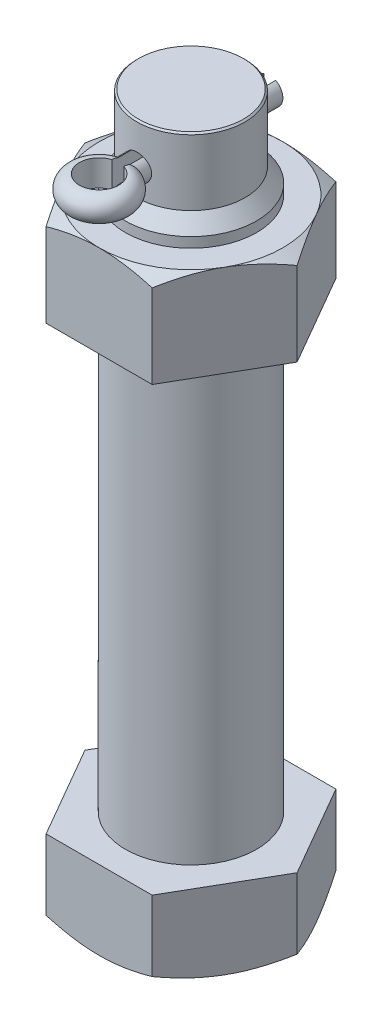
ISO-10303-21;
HEADER;
FILE_DESCRIPTION(('STEP AP214'),'2;1');
FILE_NAME('part.step','',(''),(''),'','','');
FILE_SCHEMA(('AUTOMOTIVE_DESIGN { 1 0 10303 214 1 1 1 1 }'));
ENDSEC;
DATA;
#1=APPLICATION_CONTEXT('core data for automotive mechanical design processes');
#2=APPLICATION_PROTOCOL_DEFINITION('international standard','automotive_design',2000,#1);
#3=PRODUCT_CONTEXT('',#1,'mechanical');
#4=PRODUCT('Part','Part','',(#3));
#5=PRODUCT_RELATED_PRODUCT_CATEGORY('part','',(#4));
#6=PRODUCT_DEFINITION_FORMATION('','',#4);
#7=PRODUCT_DEFINITION_CONTEXT('part definition',#1,'design');
#8=PRODUCT_DEFINITION('design','',#6,#7);
#9=PRODUCT_DEFINITION_SHAPE('','',#8);
#10=(LENGTH_UNIT() NAMED_UNIT(*) SI_UNIT(.MILLI.,.METRE.));
#11=(NAMED_UNIT(*) PLANE_ANGLE_UNIT() SI_UNIT($,.RADIAN.));
#12=(NAMED_UNIT(*) SI_UNIT($,.STERADIAN.) SOLID_ANGLE_UNIT());
#13=UNCERTAINTY_MEASURE_WITH_UNIT(LENGTH_MEASURE(1.E-05),#10,'distance_accuracy_value','');
#14=(GEOMETRIC_REPRESENTATION_CONTEXT(3) GLOBAL_UNCERTAINTY_ASSIGNED_CONTEXT((#13)) GLOBAL_UNIT_ASSIGNED_CONTEXT((#10,
#11,#12)) REPRESENTATION_CONTEXT('',''));
#15=CARTESIAN_POINT('',(0.,0.,0.));
#16=DIRECTION('',(0.,0.,1.));
#17=DIRECTION('',(1.,0.,0.));
#18=AXIS2_PLACEMENT_3D('',#15,#16,#17);
#19=CARTESIAN_POINT('',(0.,79.575,-28.7));
#20=DIRECTION('',(0.,0.,1.));
#21=DIRECTION('',(0.,-1.,0.));
#22=AXIS2_PLACEMENT_3D('',#19,#20,#21);
#23=CYLINDRICAL_SURFACE('',#22,2.87);
#24=DIRECTION('',(0.,0.,1.));
#25=VECTOR('',#24,1.);
#26=CARTESIAN_POINT('',(1.29150000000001,82.1379919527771,-28.7));
#27=LINE('',#26,#25);
#28=CARTESIAN_POINT('',(1.2915,82.1379919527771,11.7628658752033));
#29=VERTEX_POINT('',#28);
#30=CARTESIAN_POINT('',(1.29150000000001,82.1379919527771,-11.7628658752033));
#31=VERTEX_POINT('',#30);
#32=EDGE_CURVE('E11',#29,#31,#27,.F.);
#33=ORIENTED_EDGE('',*,*,#32,.F.);
#34=CARTESIAN_POINT('',(0.,76.705,11.8335533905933));
#35=CARTESIAN_POINT('',(-0.158721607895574,76.7050047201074,11.8335506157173));
#36=CARTESIAN_POINT('',(-0.317496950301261,76.718211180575,11.8303280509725));
#37=CARTESIAN_POINT('',(-0.630507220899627,76.7706150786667,11.8177845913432));
#38=CARTESIAN_POINT('',(-0.784739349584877,76.8098282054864,11.8084600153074));
#39=CARTESIAN_POINT('',(-1.0840969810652,76.9129210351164,11.7847465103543));
#40=CARTESIAN_POINT('',(-1.22923284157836,76.9767720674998,11.7703634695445));
#41=CARTESIAN_POINT('',(-1.50673175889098,77.1272297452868,11.7380699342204));
#42=CARTESIAN_POINT('',(-1.63909457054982,77.2138368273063,11.720159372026));
#43=CARTESIAN_POINT('',(-1.8898680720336,77.4091299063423,11.6823697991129));
#44=CARTESIAN_POINT('',(-2.00799462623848,77.5181751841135,11.6624618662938));
#45=CARTESIAN_POINT('',(-2.22447432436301,77.7544795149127,11.6231162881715));
#46=CARTESIAN_POINT('',(-2.32282536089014,77.8817405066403,11.603678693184));
#47=CARTESIAN_POINT('',(-2.49827770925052,78.1530436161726,11.5671847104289));
#48=CARTESIAN_POINT('',(-2.57506502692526,78.2972941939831,11.5501651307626));
#49=CARTESIAN_POINT('',(-2.70319229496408,78.597135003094,11.5208544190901));
#50=CARTESIAN_POINT('',(-2.75453605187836,78.7527235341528,11.5085625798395));
#51=CARTESIAN_POINT('',(-2.82935695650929,79.0677094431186,11.4903957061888));
#52=CARTESIAN_POINT('',(-2.8533430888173,79.2269790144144,11.4844036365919));
#53=CARTESIAN_POINT('',(-2.87435261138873,79.5473855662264,11.4791641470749));
#54=CARTESIAN_POINT('',(-2.87138011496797,79.7085222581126,11.4799156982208));
#55=CARTESIAN_POINT('',(-2.83896372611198,80.0242179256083,11.4879731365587));
#56=CARTESIAN_POINT('',(-2.81012245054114,80.1788431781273,11.495129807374));
#57=CARTESIAN_POINT('',(-2.72774685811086,80.4809924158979,11.5149537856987));
#58=CARTESIAN_POINT('',(-2.67421087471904,80.6285159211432,11.5276214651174));
#59=CARTESIAN_POINT('',(-2.54344219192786,80.9139093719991,11.5571795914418));
#60=CARTESIAN_POINT('',(-2.46598756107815,81.0516733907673,11.5741093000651));
#61=CARTESIAN_POINT('',(-2.28973564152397,81.3124667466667,11.6102613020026));
#62=CARTESIAN_POINT('',(-2.19093482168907,81.4354936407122,11.6294839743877));
#63=CARTESIAN_POINT('',(-1.97165645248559,81.6667780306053,11.6686872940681));
#64=CARTESIAN_POINT('',(-1.85066935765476,81.774551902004,11.6886744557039));
#65=CARTESIAN_POINT('',(-1.59210211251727,81.9683692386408,11.7266894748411));
#66=CARTESIAN_POINT('',(-1.45452151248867,82.0544121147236,11.7447172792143));
#67=CARTESIAN_POINT('',(-1.16600768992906,82.202487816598,11.7768636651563));
#68=CARTESIAN_POINT('',(-1.01503466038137,82.264445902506,11.7909700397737));
#69=CARTESIAN_POINT('',(-0.704398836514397,82.3619715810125,11.8135950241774));
#70=CARTESIAN_POINT('',(-0.544737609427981,82.3975439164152,11.8221146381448));
#71=CARTESIAN_POINT('',(-0.225395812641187,82.4405585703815,11.8324589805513));
#72=CARTESIAN_POINT('',(-0.0658089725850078,82.4486599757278,11.8344405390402));
#73=CARTESIAN_POINT('',(0.252439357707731,82.4383051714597,11.8319303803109));
#74=CARTESIAN_POINT('',(0.411100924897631,82.4198512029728,11.8274392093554));
#75=CARTESIAN_POINT('',(0.720731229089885,82.3574537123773,11.8125883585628));
#76=CARTESIAN_POINT('',(0.87177601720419,82.3138662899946,11.8023107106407));
#77=CARTESIAN_POINT('',(1.16440447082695,82.2028430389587,11.7770428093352));
#78=CARTESIAN_POINT('',(1.30598721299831,82.1354048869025,11.7620520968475));
#79=CARTESIAN_POINT('',(1.57832083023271,81.9772933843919,11.7286421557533));
#80=CARTESIAN_POINT('',(1.70884801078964,81.8862463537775,11.7101692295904));
#81=CARTESIAN_POINT('',(1.95300600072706,81.6839827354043,11.6719343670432));
#82=CARTESIAN_POINT('',(2.0666340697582,81.5727628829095,11.6521722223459));
#83=CARTESIAN_POINT('',(2.27645737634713,81.3302585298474,11.6130272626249));
#84=CARTESIAN_POINT('',(2.37219161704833,81.198571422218,11.5936636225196));
#85=CARTESIAN_POINT('',(2.54019779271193,80.9206086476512,11.5580182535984));
#86=CARTESIAN_POINT('',(2.61247077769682,80.7743336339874,11.5417363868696));
#87=CARTESIAN_POINT('',(2.73097277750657,80.4721424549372,11.5142726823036));
#88=CARTESIAN_POINT('',(2.77735576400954,80.3162895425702,11.5030607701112));
#89=CARTESIAN_POINT('',(2.8431806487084,79.9986870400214,11.486969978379));
#90=CARTESIAN_POINT('',(2.86262802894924,79.8369386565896,11.4820898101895));
#91=CARTESIAN_POINT('',(2.87375609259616,79.5168163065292,11.4793091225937));
#92=CARTESIAN_POINT('',(2.86617197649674,79.3584690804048,11.4812237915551));
#93=CARTESIAN_POINT('',(2.8251251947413,79.0453831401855,11.4913920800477));
#94=CARTESIAN_POINT('',(2.79166299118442,78.8906443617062,11.4996455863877));
#95=CARTESIAN_POINT('',(2.70020033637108,78.5899132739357,11.5214617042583));
#96=CARTESIAN_POINT('',(2.64233008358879,78.4438791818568,11.534996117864));
#97=CARTESIAN_POINT('',(2.50379850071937,78.1634921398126,11.5658546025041));
#98=CARTESIAN_POINT('',(2.42313419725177,78.0291407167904,11.5831791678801));
#99=CARTESIAN_POINT('',(2.23896613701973,77.7723618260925,11.620199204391));
#100=CARTESIAN_POINT('',(2.13494871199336,77.6503096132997,11.6399425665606));
#101=CARTESIAN_POINT('',(1.90803830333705,77.4251528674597,11.6792812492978));
#102=CARTESIAN_POINT('',(1.78514088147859,77.3220528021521,11.6988765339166));
#103=CARTESIAN_POINT('',(1.52147228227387,77.1360481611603,11.7361028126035));
#104=CARTESIAN_POINT('',(1.38043596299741,77.0535111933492,11.7536953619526));
#105=CARTESIAN_POINT('',(1.08608012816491,76.9134493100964,11.7845340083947));
#106=CARTESIAN_POINT('',(0.932769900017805,76.8559056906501,11.7977833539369));
#107=CARTESIAN_POINT('',(0.649681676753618,76.7764413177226,11.8163809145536));
#108=CARTESIAN_POINT('',(0.521302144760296,76.7497069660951,11.8227774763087));
#109=CARTESIAN_POINT('',(0.2619604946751,76.7139849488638,11.8313647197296));
#110=CARTESIAN_POINT('',(0.130998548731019,76.7049961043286,11.8335556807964));
#111=CARTESIAN_POINT('',(0.,76.705,11.8335533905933));
#112=B_SPLINE_CURVE_WITH_KNOTS('',3,(#34,#35,#36,#37,#38,#39,#40,#41,#42,#43,#44,#45,#46,#47,
#48,#49,#50,#51,#52,#53,#54,#55,#56,#57,#58,#59,#60,#61,#62,#63,#64,#65,#66,#67,#68,#69,#70,#71,
#72,#73,#74,#75,#76,#77,#78,#79,#80,#81,#82,#83,#84,#85,#86,#87,#88,#89,#90,#91,#92,#93,#94,#95,
#96,#97,#98,#99,#100,#101,#102,#103,#104,#105,#106,#107,#108,#109,#110,#111),.UNSPECIFIED.,.T.,
.F.,(4,2,2,2,2,2,2,2,2,2,2,2,2,2,2,2,2,2,2,2,2,2,2,2,2,2,2,2,2,2,2,2,2,2,2,2,2,2,4),(0.,
0.47568490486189,0.951657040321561,1.42707696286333,1.90250600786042,2.38624066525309,
2.87002684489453,3.36052999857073,3.85095974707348,4.33210814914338,4.81318313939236,
5.28333439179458,5.75351737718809,6.22820119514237,6.70296359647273,7.19043722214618,
7.67792406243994,8.16691181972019,8.65581166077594,9.1328954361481,9.60993895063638,
10.0803840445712,10.5508749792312,11.0293231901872,11.5078489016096,11.9973792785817,
12.4868877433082,12.9734531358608,13.4599194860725,13.933257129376,14.4065863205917,
14.8774219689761,15.348319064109,15.8308160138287,16.3134265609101,16.8041291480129,
17.2944638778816,17.6870895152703,18.0796890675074),.UNSPECIFIED.);
#113=CARTESIAN_POINT('',(-1.2915,82.1379919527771,11.7628658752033));
#114=VERTEX_POINT('',#113);
#115=EDGE_CURVE('E1019',#114,#29,#112,.T.);
#116=ORIENTED_EDGE('',*,*,#115,.F.);
#117=DIRECTION('',(0.,0.,1.));
#118=VECTOR('',#117,1.);
#119=CARTESIAN_POINT('',(-1.29149999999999,82.1379919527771,-28.7));
#120=LINE('',#119,#118);
#121=CARTESIAN_POINT('',(-1.2915,82.1379919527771,-11.7628658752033));
#122=VERTEX_POINT('',#121);
#123=EDGE_CURVE('E554',#122,#114,#120,.T.);
#124=ORIENTED_EDGE('',*,*,#123,.F.);
#125=CARTESIAN_POINT('',(0.,82.445,-11.8335533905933));
#126=CARTESIAN_POINT('',(-0.158721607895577,82.4449952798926,-11.8335506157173));
#127=CARTESIAN_POINT('',(-0.317496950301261,82.431788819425,-11.8303280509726));
#128=CARTESIAN_POINT('',(-0.630507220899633,82.3793849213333,-11.8177845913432));
#129=CARTESIAN_POINT('',(-0.78473934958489,82.3401717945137,-11.8084600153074));
#130=CARTESIAN_POINT('',(-1.08409698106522,82.2370789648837,-11.7847465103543));
#131=CARTESIAN_POINT('',(-1.22923284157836,82.1732279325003,-11.7703634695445));
#132=CARTESIAN_POINT('',(-1.50673175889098,82.0227702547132,-11.7380699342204));
#133=CARTESIAN_POINT('',(-1.63909457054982,81.9361631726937,-11.720159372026));
#134=CARTESIAN_POINT('',(-1.88986807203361,81.7408700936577,-11.6823697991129));
#135=CARTESIAN_POINT('',(-2.0079946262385,81.6318248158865,-11.6624618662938));
#136=CARTESIAN_POINT('',(-2.22447432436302,81.3955204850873,-11.6231162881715));
#137=CARTESIAN_POINT('',(-2.32282536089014,81.2682594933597,-11.603678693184));
#138=CARTESIAN_POINT('',(-2.49827770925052,80.9969563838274,-11.5671847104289));
#139=CARTESIAN_POINT('',(-2.57506502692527,80.8527058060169,-11.5501651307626));
#140=CARTESIAN_POINT('',(-2.70319229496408,80.552864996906,-11.5208544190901));
#141=CARTESIAN_POINT('',(-2.75453605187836,80.3972764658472,-11.5085625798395));
#142=CARTESIAN_POINT('',(-2.82935695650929,80.0822905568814,-11.4903957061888));
#143=CARTESIAN_POINT('',(-2.85334308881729,79.9230209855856,-11.4844036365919));
#144=CARTESIAN_POINT('',(-2.87435261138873,79.6026144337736,-11.4791641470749));
#145=CARTESIAN_POINT('',(-2.87138011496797,79.4414777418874,-11.4799156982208));
#146=CARTESIAN_POINT('',(-2.83896372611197,79.1257820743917,-11.4879731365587));
#147=CARTESIAN_POINT('',(-2.81012245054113,78.9711568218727,-11.495129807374));
#148=CARTESIAN_POINT('',(-2.72774685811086,78.669007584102,-11.5149537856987));
#149=CARTESIAN_POINT('',(-2.67421087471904,78.5214840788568,-11.5276214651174));
#150=CARTESIAN_POINT('',(-2.54344219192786,78.2360906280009,-11.5571795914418));
#151=CARTESIAN_POINT('',(-2.46598756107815,78.0983266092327,-11.5741093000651));
#152=CARTESIAN_POINT('',(-2.28973564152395,77.8375332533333,-11.6102613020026));
#153=CARTESIAN_POINT('',(-2.19093482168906,77.7145063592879,-11.6294839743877));
#154=CARTESIAN_POINT('',(-1.97165645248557,77.4832219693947,-11.6686872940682));
#155=CARTESIAN_POINT('',(-1.85066935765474,77.375448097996,-11.6886744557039));
#156=CARTESIAN_POINT('',(-1.59210211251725,77.1816307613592,-11.7266894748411));
#157=CARTESIAN_POINT('',(-1.45452151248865,77.0955878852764,-11.7447172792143));
#158=CARTESIAN_POINT('',(-1.16600768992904,76.947512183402,-11.7768636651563));
#159=CARTESIAN_POINT('',(-1.01503466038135,76.8855540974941,-11.7909700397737));
#160=CARTESIAN_POINT('',(-0.704398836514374,76.7880284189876,-11.8135950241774));
#161=CARTESIAN_POINT('',(-0.54473760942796,76.7524560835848,-11.8221146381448));
#162=CARTESIAN_POINT('',(-0.225395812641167,76.7094414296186,-11.8324589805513));
#163=CARTESIAN_POINT('',(-0.0658089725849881,76.7013400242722,-11.8344405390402));
#164=CARTESIAN_POINT('',(0.252439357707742,76.7116948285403,-11.8319303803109));
#165=CARTESIAN_POINT('',(0.411100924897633,76.7301487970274,-11.8274392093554));
#166=CARTESIAN_POINT('',(0.720731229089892,76.7925462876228,-11.8125883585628));
#167=CARTESIAN_POINT('',(0.87177601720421,76.8361337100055,-11.8023107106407));
#168=CARTESIAN_POINT('',(1.16440447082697,76.9471569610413,-11.7770428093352));
#169=CARTESIAN_POINT('',(1.30598721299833,77.0145951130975,-11.7620520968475));
#170=CARTESIAN_POINT('',(1.57832083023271,77.1727066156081,-11.7286421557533));
#171=CARTESIAN_POINT('',(1.70884801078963,77.2637536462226,-11.7101692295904));
#172=CARTESIAN_POINT('',(1.95300600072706,77.4660172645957,-11.6719343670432));
#173=CARTESIAN_POINT('',(2.0666340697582,77.5772371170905,-11.6521722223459));
#174=CARTESIAN_POINT('',(2.27645737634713,77.8197414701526,-11.6130272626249));
#175=CARTESIAN_POINT('',(2.37219161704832,77.951428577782,-11.5936636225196));
#176=CARTESIAN_POINT('',(2.54019779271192,78.2293913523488,-11.5580182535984));
#177=CARTESIAN_POINT('',(2.61247077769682,78.3756663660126,-11.5417363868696));
#178=CARTESIAN_POINT('',(2.73097277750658,78.6778575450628,-11.5142726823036));
#179=CARTESIAN_POINT('',(2.77735576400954,78.8337104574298,-11.5030607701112));
#180=CARTESIAN_POINT('',(2.8431806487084,79.1513129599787,-11.486969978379));
#181=CARTESIAN_POINT('',(2.86262802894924,79.3130613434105,-11.4820898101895));
#182=CARTESIAN_POINT('',(2.87375609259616,79.6331836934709,-11.4793091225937));
#183=CARTESIAN_POINT('',(2.86617197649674,79.7915309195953,-11.4812237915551));
#184=CARTESIAN_POINT('',(2.8251251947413,80.1046168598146,-11.4913920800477));
#185=CARTESIAN_POINT('',(2.79166299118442,80.2593556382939,-11.4996455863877));
#186=CARTESIAN_POINT('',(2.70020033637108,80.5600867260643,-11.5214617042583));
#187=CARTESIAN_POINT('',(2.6423300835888,80.7061208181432,-11.534996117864));
#188=CARTESIAN_POINT('',(2.50379850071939,80.9865078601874,-11.5658546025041));
#189=CARTESIAN_POINT('',(2.42313419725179,81.1208592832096,-11.5831791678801));
#190=CARTESIAN_POINT('',(2.23896613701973,81.3776381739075,-11.620199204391));
#191=CARTESIAN_POINT('',(2.13494871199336,81.4996903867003,-11.6399425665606));
#192=CARTESIAN_POINT('',(1.90803830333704,81.7248471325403,-11.6792812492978));
#193=CARTESIAN_POINT('',(1.78514088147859,81.827947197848,-11.6988765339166));
#194=CARTESIAN_POINT('',(1.52147228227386,82.0139518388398,-11.7361028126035));
#195=CARTESIAN_POINT('',(1.38043596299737,82.0964888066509,-11.7536953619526));
#196=CARTESIAN_POINT('',(1.08608012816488,82.2365506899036,-11.7845340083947));
#197=CARTESIAN_POINT('',(0.932769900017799,82.29409430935,-11.7977833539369));
#198=CARTESIAN_POINT('',(0.649681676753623,82.3735586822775,-11.8163809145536));
#199=CARTESIAN_POINT('',(0.52130214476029,82.4002930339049,-11.8227774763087));
#200=CARTESIAN_POINT('',(0.261960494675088,82.4360150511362,-11.8313647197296));
#201=CARTESIAN_POINT('',(0.13099854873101,82.4450038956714,-11.8335556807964));
#202=CARTESIAN_POINT('',(0.,82.445,-11.8335533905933));
#203=B_SPLINE_CURVE_WITH_KNOTS('',3,(#125,#126,#127,#128,#129,#130,#131,#132,#133,#134,#135,
#136,#137,#138,#139,#140,#141,#142,#143,#144,#145,#146,#147,#148,#149,#150,#151,#152,#153,#154,
#155,#156,#157,#158,#159,#160,#161,#162,#163,#164,#165,#166,#167,#168,#169,#170,#171,#172,#173,
#174,#175,#176,#177,#178,#179,#180,#181,#182,#183,#184,#185,#186,#187,#188,#189,#190,#191,#192,
#193,#194,#195,#196,#197,#198,#199,#200,#201,#202),.UNSPECIFIED.,.T.,.F.,(4,2,2,2,2,2,2,2,2,2,2,
2,2,2,2,2,2,2,2,2,2,2,2,2,2,2,2,2,2,2,2,2,2,2,2,2,2,2,4),(0.,0.47568490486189,0.95165704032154,
1.42707696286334,1.90250600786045,2.38624066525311,2.87002684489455,3.36052999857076,
3.85095974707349,4.33210814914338,4.81318313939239,5.28333439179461,5.75351737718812,
6.22820119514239,6.70296359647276,7.1904372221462,7.67792406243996,8.16691181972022,
8.65581166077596,9.13289543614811,9.6099389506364,10.0803840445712,10.5508749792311,
11.0293231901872,11.5078489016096,11.9973792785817,12.4868877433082,12.9734531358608,
13.4599194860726,13.933257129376,14.4065863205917,14.8774219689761,15.3483190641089,
15.8308160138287,16.3134265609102,16.8041291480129,17.2944638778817,17.6870895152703,
18.0796890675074),.UNSPECIFIED.);
#204=EDGE_CURVE('E32',#31,#122,#203,.T.);
#205=ORIENTED_EDGE('',*,*,#204,.F.);
#206=EDGE_LOOP('',(#33,#116,#124,#205));
#207=FACE_BOUND('',#206,.T.);
#208=ADVANCED_FACE('F16',(#207),#23,.F.);
#209=DIRECTION('',(0.,0.,1.));
#210=VECTOR('',#209,1.);
#211=CARTESIAN_POINT('',(1.29150000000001,77.0120080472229,-28.7));
#212=LINE('',#211,#210);
#213=CARTESIAN_POINT('',(1.29150000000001,77.0120080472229,-11.7628658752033));
#214=VERTEX_POINT('',#213);
#215=CARTESIAN_POINT('',(1.2915,77.0120080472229,11.7628658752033));
#216=VERTEX_POINT('',#215);
#217=EDGE_CURVE('E25',#214,#216,#212,.T.);
#218=ORIENTED_EDGE('',*,*,#217,.F.);
#219=CARTESIAN_POINT('',(-1.2915,77.0120080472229,-11.7628658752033));
#220=VERTEX_POINT('',#219);
#221=EDGE_CURVE('E553',#220,#214,#203,.T.);
#222=ORIENTED_EDGE('',*,*,#221,.F.);
#223=DIRECTION('',(0.,0.,1.));
#224=VECTOR('',#223,1.);
#225=CARTESIAN_POINT('',(-1.29149999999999,77.0120080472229,-28.7));
#226=LINE('',#225,#224);
#227=CARTESIAN_POINT('',(-1.2915,77.0120080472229,11.7628658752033));
#228=VERTEX_POINT('',#227);
#229=EDGE_CURVE('E583',#228,#220,#226,.F.);
#230=ORIENTED_EDGE('',*,*,#229,.F.);
#231=EDGE_CURVE('E1035',#216,#228,#112,.T.);
#232=ORIENTED_EDGE('',*,*,#231,.F.);
#233=EDGE_LOOP('',(#218,#222,#230,#232));
#234=FACE_BOUND('',#233,.T.);
#235=ADVANCED_FACE('F533',(#234),#23,.F.);
#236=CARTESIAN_POINT('',(0.,88.5,0.));
#237=DIRECTION('',(0.,-1.,0.));
#238=DIRECTION('',(0.,0.,-1.));
#239=AXIS2_PLACEMENT_3D('',#236,#237,#238);
#240=PLANE('',#239);
#241=CARTESIAN_POINT('',(0.,88.5,0.));
#242=DIRECTION('',(0.,-1.,0.));
#243=DIRECTION('',(0.,0.,-1.));
#244=AXIS2_PLACEMENT_3D('',#241,#242,#243);
#245=CIRCLE('',#244,11.48);
#246=CARTESIAN_POINT('',(0.,88.5,-11.48));
#247=VERTEX_POINT('',#246);
#248=EDGE_CURVE('E576',#247,#247,#245,.T.);
#249=ORIENTED_EDGE('',*,*,#248,.F.);
#250=EDGE_LOOP('',(#249));
#251=FACE_BOUND('',#250,.T.);
#252=ADVANCED_FACE('F18',(#251),#240,.F.);
#253=CARTESIAN_POINT('',(0.,88.5,0.));
#254=DIRECTION('',(0.,-1.,0.));
#255=DIRECTION('',(0.,0.,-1.));
#256=AXIS2_PLACEMENT_3D('',#253,#254,#255);
#257=CONICAL_SURFACE('',#256,11.48,0.785398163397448);
#258=CARTESIAN_POINT('',(0.,88.1464466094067,0.));
#259=DIRECTION('',(0.,-1.,0.));
#260=DIRECTION('',(0.,0.,-1.));
#261=AXIS2_PLACEMENT_3D('',#258,#259,#260);
#262=CIRCLE('',#261,11.8335533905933);
#263=CARTESIAN_POINT('',(0.,88.1464466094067,-11.8335533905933));
#264=VERTEX_POINT('',#263);
#265=EDGE_CURVE('E573',#264,#264,#262,.T.);
#266=ORIENTED_EDGE('',*,*,#265,.F.);
#267=EDGE_LOOP('',(#266));
#268=FACE_BOUND('',#267,.T.);
#269=ORIENTED_EDGE('',*,*,#248,.T.);
#270=EDGE_LOOP('',(#269));
#271=FACE_BOUND('',#270,.T.);
#272=ADVANCED_FACE('F560',(#268,#271),#257,.T.);
#273=CARTESIAN_POINT('',(0.,-48.35,0.));
#274=DIRECTION('',(0.,-1.,0.));
#275=DIRECTION('',(0.,0.,-1.));
#276=AXIS2_PLACEMENT_3D('',#273,#274,#275);
#277=CYLINDRICAL_SURFACE('',#276,11.8335533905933);
#278=EDGE_CURVE('E545',#122,#220,#203,.T.);
#279=ORIENTED_EDGE('',*,*,#278,.T.);
#280=ORIENTED_EDGE('',*,*,#221,.T.);
#281=EDGE_CURVE('E1025',#214,#31,#203,.T.);
#282=ORIENTED_EDGE('',*,*,#281,.T.);
#283=ORIENTED_EDGE('',*,*,#204,.T.);
#284=EDGE_LOOP('',(#279,#280,#282,#283));
#285=FACE_BOUND('',#284,.T.);
#286=EDGE_CURVE('E538',#228,#114,#112,.T.);
#287=ORIENTED_EDGE('',*,*,#286,.T.);
#288=ORIENTED_EDGE('',*,*,#115,.T.);
#289=EDGE_CURVE('E432',#29,#216,#112,.T.);
#290=ORIENTED_EDGE('',*,*,#289,.T.);
#291=ORIENTED_EDGE('',*,*,#231,.T.);
#292=EDGE_LOOP('',(#287,#288,#290,#291));
#293=FACE_BOUND('',#292,.T.);
#294=CARTESIAN_POINT('',(0.,73.7964466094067,0.));
#295=DIRECTION('',(0.,-1.,0.));
#296=DIRECTION('',(0.,0.,-1.));
#297=AXIS2_PLACEMENT_3D('',#294,#295,#296);
#298=CIRCLE('',#297,11.8335533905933);
#299=CARTESIAN_POINT('',(0.,73.7964466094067,-11.8335533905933));
#300=VERTEX_POINT('',#299);
#301=EDGE_CURVE('E585',#300,#300,#298,.T.);
#302=ORIENTED_EDGE('',*,*,#301,.F.);
#303=EDGE_LOOP('',(#302));
#304=FACE_BOUND('',#303,.T.);
#305=ORIENTED_EDGE('',*,*,#265,.T.);
#306=EDGE_LOOP('',(#305));
#307=FACE_BOUND('',#306,.T.);
#308=ADVANCED_FACE('F556',(#285,#293,#304,#307),#277,.T.);
#309=CARTESIAN_POINT('',(0.,73.7964466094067,0.));
#310=DIRECTION('',(0.,-1.,0.));
#311=DIRECTION('',(0.,0.,-1.));
#312=AXIS2_PLACEMENT_3D('',#309,#310,#311);
#313=CONICAL_SURFACE('',#312,11.8335533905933,0.674603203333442);
#314=CARTESIAN_POINT('',(0.,70.65,0.));
#315=DIRECTION('',(0.,-1.,0.));
#316=DIRECTION('',(0.,0.,-1.));
#317=AXIS2_PLACEMENT_3D('',#314,#315,#316);
#318=CIRCLE('',#317,14.35);
#319=CARTESIAN_POINT('',(0.,70.65,-14.35));
#320=VERTEX_POINT('',#319);
#321=EDGE_CURVE('E591',#320,#320,#318,.T.);
#322=ORIENTED_EDGE('',*,*,#321,.F.);
#323=EDGE_LOOP('',(#322));
#324=FACE_BOUND('',#323,.T.);
#325=ORIENTED_EDGE('',*,*,#301,.T.);
#326=EDGE_LOOP('',(#325));
#327=FACE_BOUND('',#326,.T.);
#328=ADVANCED_FACE('F559',(#324,#327),#313,.T.);
#329=CARTESIAN_POINT('',(0.,-48.35,0.));
#330=DIRECTION('',(0.,-1.,0.));
#331=DIRECTION('',(0.,0.,-1.));
#332=AXIS2_PLACEMENT_3D('',#329,#330,#331);
#333=CYLINDRICAL_SURFACE('',#332,14.35);
#334=CARTESIAN_POINT('',(0.,68.44,0.));
#335=DIRECTION('',(0.,-1.,0.));
#336=DIRECTION('',(0.,0.,1.));
#337=AXIS2_PLACEMENT_3D('',#334,#335,#336);
#338=CIRCLE('',#337,14.35);
#339=CARTESIAN_POINT('',(0.,68.44,14.35));
#340=VERTEX_POINT('',#339);
#341=EDGE_CURVE('E1253',#340,#340,#338,.T.);
#342=ORIENTED_EDGE('',*,*,#341,.F.);
#343=EDGE_LOOP('',(#342));
#344=FACE_BOUND('',#343,.T.);
#345=ORIENTED_EDGE('',*,*,#321,.T.);
#346=EDGE_LOOP('',(#345));
#347=FACE_BOUND('',#346,.T.);
#348=ADVANCED_FACE('F534',(#344,#347),#333,.T.);
#349=CARTESIAN_POINT('',(0.,79.575,20.09));
#350=DIRECTION('',(0.,0.,-1.));
#351=DIRECTION('',(1.,0.,0.));
#352=AXIS2_PLACEMENT_3D('',#349,#350,#351);
#353=CYLINDRICAL_SURFACE('',#352,2.87);
#354=ORIENTED_EDGE('',*,*,#278,.F.);
#355=DIRECTION('',(0.,0.,-1.));
#356=VECTOR('',#355,1.);
#357=CARTESIAN_POINT('',(-1.2915,82.1379919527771,20.09));
#358=LINE('',#357,#356);
#359=CARTESIAN_POINT('',(-1.2915,82.1379919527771,-17.22));
#360=VERTEX_POINT('',#359);
#361=EDGE_CURVE('E380',#360,#122,#358,.F.);
#362=ORIENTED_EDGE('',*,*,#361,.F.);
#363=CARTESIAN_POINT('',(0.,79.575,-17.22));
#364=DIRECTION('',(0.,0.,1.));
#365=DIRECTION('',(1.,0.,0.));
#366=AXIS2_PLACEMENT_3D('',#363,#364,#365);
#367=CIRCLE('',#366,2.87);
#368=CARTESIAN_POINT('',(-1.29149999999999,77.0120080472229,-17.22));
#369=VERTEX_POINT('',#368);
#370=EDGE_CURVE('E364',#360,#369,#367,.T.);
#371=ORIENTED_EDGE('',*,*,#370,.T.);
#372=DIRECTION('',(0.,0.,-1.));
#373=VECTOR('',#372,1.);
#374=CARTESIAN_POINT('',(-1.2915,77.0120080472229,20.09));
#375=LINE('',#374,#373);
#376=EDGE_CURVE('E388',#220,#369,#375,.T.);
#377=ORIENTED_EDGE('',*,*,#376,.F.);
#378=EDGE_LOOP('',(#354,#362,#371,#377));
#379=FACE_BOUND('',#378,.T.);
#380=ADVANCED_FACE('F338',(#379),#353,.T.);
#381=ORIENTED_EDGE('',*,*,#286,.F.);
#382=CARTESIAN_POINT('',(-1.2915,77.0120080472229,14.64455786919));
#383=VERTEX_POINT('',#382);
#384=EDGE_CURVE('E385',#383,#228,#375,.T.);
#385=ORIENTED_EDGE('',*,*,#384,.F.);
#386=CARTESIAN_POINT('',(0.,76.705,15.785));
#387=CARTESIAN_POINT('',(-0.000252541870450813,76.7049999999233,15.7847474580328));
#388=CARTESIAN_POINT('',(-0.000505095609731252,76.7050000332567,15.7844949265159));
#389=CARTESIAN_POINT('',(-0.18938030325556,76.7050499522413,15.5956530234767));
#390=CARTESIAN_POINT('',(-0.384616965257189,76.723739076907,15.4128945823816));
#391=CARTESIAN_POINT('',(-0.779909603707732,76.8056312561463,15.0621969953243));
#392=CARTESIAN_POINT('',(-0.979971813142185,76.8688952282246,14.8942784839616));
#393=CARTESIAN_POINT('',(-1.31786088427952,77.0207591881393,14.6225734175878));
#394=CARTESIAN_POINT('',(-1.45733889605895,77.0971961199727,14.5140488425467));
#395=CARTESIAN_POINT('',(-1.72736335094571,77.2773173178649,14.3093375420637));
#396=CARTESIAN_POINT('',(-1.85792532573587,77.380952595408,14.2131290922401));
#397=CARTESIAN_POINT('',(-2.08476154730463,77.5972968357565,14.0494320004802));
#398=CARTESIAN_POINT('',(-2.18321253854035,77.7061022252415,13.9798033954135));
#399=CARTESIAN_POINT('',(-2.36504193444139,77.9423293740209,13.8530089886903));
#400=CARTESIAN_POINT('',(-2.44842179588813,78.0697493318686,13.7958419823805));
#401=CARTESIAN_POINT('',(-2.55897011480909,78.2732234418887,13.7208250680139));
#402=CARTESIAN_POINT('',(-2.59350351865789,78.3433988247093,13.6975399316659));
#403=CARTESIAN_POINT('',(-2.65707137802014,78.4873204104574,13.654872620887));
#404=CARTESIAN_POINT('',(-2.68610854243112,78.561064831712,13.6354885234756));
#405=CARTESIAN_POINT('',(-2.73819415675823,78.7115592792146,13.6008414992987));
#406=CARTESIAN_POINT('',(-2.76124424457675,78.7883084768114,13.5855774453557));
#407=CARTESIAN_POINT('',(-2.80095963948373,78.9441274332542,13.5593448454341));
#408=CARTESIAN_POINT('',(-2.81762581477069,79.0231968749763,13.5483757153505));
#409=CARTESIAN_POINT('',(-2.85439307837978,79.243882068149,13.5242093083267));
#410=CARTESIAN_POINT('',(-2.8674495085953,79.3872866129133,13.5156734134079));
#411=CARTESIAN_POINT('',(-2.87187195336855,79.6744572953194,13.5127785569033));
#412=CARTESIAN_POINT('',(-2.86324676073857,79.8182232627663,13.5184138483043));
#413=CARTESIAN_POINT('',(-2.82597906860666,80.0935996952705,13.5428754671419));
#414=CARTESIAN_POINT('',(-2.79849663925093,80.2254377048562,13.5609374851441));
#415=CARTESIAN_POINT('',(-2.72617687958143,80.4819904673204,13.6087981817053));
#416=CARTESIAN_POINT('',(-2.68133876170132,80.6067048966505,13.6385973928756));
#417=CARTESIAN_POINT('',(-2.57460472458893,80.8503882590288,13.7102121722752));
#418=CARTESIAN_POINT('',(-2.51217141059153,80.9690081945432,13.7524084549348));
#419=CARTESIAN_POINT('',(-2.37376909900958,81.1934966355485,13.847130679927));
#420=CARTESIAN_POINT('',(-2.29779543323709,81.2993607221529,13.899660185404));
#421=CARTESIAN_POINT('',(-2.1263837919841,81.5077459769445,14.0199767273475));
#422=CARTESIAN_POINT('',(-2.029728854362,81.6086628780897,14.0888001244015));
#423=CARTESIAN_POINT('',(-1.82709574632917,81.7925139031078,14.2359639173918));
#424=CARTESIAN_POINT('',(-1.72111339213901,81.8754398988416,14.3143085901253));
#425=CARTESIAN_POINT('',(-1.48533232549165,82.0355230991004,14.4925971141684));
#426=CARTESIAN_POINT('',(-1.35447535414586,82.1095125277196,14.5939771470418));
#427=CARTESIAN_POINT('',(-1.0891718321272,82.2343481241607,14.8058695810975));
#428=CARTESIAN_POINT('',(-0.954722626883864,82.2851766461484,14.9163888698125));
#429=CARTESIAN_POINT('',(-0.681341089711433,82.3667248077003,15.1490111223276));
#430=CARTESIAN_POINT('',(-0.542415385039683,82.3966839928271,15.2713832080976));
#431=CARTESIAN_POINT('',(-0.268189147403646,82.4357908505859,15.5229516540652));
#432=CARTESIAN_POINT('',(-0.132884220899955,82.4449649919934,15.6521391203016));
#433=CARTESIAN_POINT('',(-0.000505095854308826,82.4449999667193,15.7844949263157));
#434=CARTESIAN_POINT('',(-0.000252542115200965,82.4450000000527,15.7847474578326));
#435=CARTESIAN_POINT('',(0.,82.445,15.785));
#436=B_SPLINE_CURVE_WITH_KNOTS('',3,(#386,#387,#388,#389,#390,#391,#392,#393,#394,#395,#396,
#397,#398,#399,#400,#401,#402,#403,#404,#405,#406,#407,#408,#409,#410,#411,#412,#413,#414,#415,
#416,#417,#418,#419,#420,#421,#422,#423,#424,#425,#426,#427,#428,#429,#430,#431,#432,#433,#434,
#435),.UNSPECIFIED.,.F.,.F.,(4,2,2,2,2,2,2,2,2,2,2,2,2,2,2,2,2,2,2,2,2,2,2,2,4),(0.,
0.00107144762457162,0.801256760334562,1.60253775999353,2.1780243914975,2.75248151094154,
3.23779583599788,3.72306322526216,3.96758069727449,4.21197733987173,4.45630705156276,
4.70060352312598,5.13088639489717,5.56099479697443,5.96677014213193,6.37256390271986,
6.79242352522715,7.21242818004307,7.67792830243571,8.14363829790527,8.68560198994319,
9.22797790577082,9.78920808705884,10.3497231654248,10.3507946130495),.UNSPECIFIED.);
#437=CARTESIAN_POINT('',(-1.2915,82.1379919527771,14.6445578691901));
#438=VERTEX_POINT('',#437);
#439=EDGE_CURVE('E356',#383,#438,#436,.T.);
#440=ORIENTED_EDGE('',*,*,#439,.T.);
#441=EDGE_CURVE('E384',#114,#438,#358,.F.);
#442=ORIENTED_EDGE('',*,*,#441,.F.);
#443=EDGE_LOOP('',(#381,#385,#440,#442));
#444=FACE_BOUND('',#443,.T.);
#445=ADVANCED_FACE('F957',(#444),#353,.T.);
#446=ORIENTED_EDGE('',*,*,#281,.F.);
#447=DIRECTION('',(0.,0.,-1.));
#448=VECTOR('',#447,1.);
#449=CARTESIAN_POINT('',(1.2915,77.0120080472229,20.09));
#450=LINE('',#449,#448);
#451=CARTESIAN_POINT('',(1.29150000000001,77.0120080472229,-17.22));
#452=VERTEX_POINT('',#451);
#453=EDGE_CURVE('E398',#452,#214,#450,.F.);
#454=ORIENTED_EDGE('',*,*,#453,.F.);
#455=CARTESIAN_POINT('',(1.2915,82.1379919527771,-17.22));
#456=VERTEX_POINT('',#455);
#457=EDGE_CURVE('E365',#452,#456,#367,.T.);
#458=ORIENTED_EDGE('',*,*,#457,.T.);
#459=DIRECTION('',(0.,0.,-1.));
#460=VECTOR('',#459,1.);
#461=CARTESIAN_POINT('',(1.2915,82.1379919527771,20.09));
#462=LINE('',#461,#460);
#463=EDGE_CURVE('E413',#31,#456,#462,.T.);
#464=ORIENTED_EDGE('',*,*,#463,.F.);
#465=EDGE_LOOP('',(#446,#454,#458,#464));
#466=FACE_BOUND('',#465,.T.);
#467=ADVANCED_FACE('F951',(#466),#353,.T.);
#468=ORIENTED_EDGE('',*,*,#289,.F.);
#469=CARTESIAN_POINT('',(1.2915,82.1379919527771,14.64455786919));
#470=VERTEX_POINT('',#469);
#471=EDGE_CURVE('E329',#470,#29,#462,.T.);
#472=ORIENTED_EDGE('',*,*,#471,.F.);
#473=CARTESIAN_POINT('',(0.,82.445,15.785));
#474=CARTESIAN_POINT('',(0.000252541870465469,82.4450000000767,15.7847474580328));
#475=CARTESIAN_POINT('',(0.000505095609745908,82.4449999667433,15.7844949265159));
#476=CARTESIAN_POINT('',(0.189380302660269,82.4449500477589,15.5956530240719));
#477=CARTESIAN_POINT('',(0.38461696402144,82.4262609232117,15.4128945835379));
#478=CARTESIAN_POINT('',(0.779909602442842,82.3443687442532,15.0621969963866));
#479=CARTESIAN_POINT('',(0.979971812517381,82.2811047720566,14.8942784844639));
#480=CARTESIAN_POINT('',(1.3178608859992,82.1292408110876,14.6225734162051));
#481=CARTESIAN_POINT('',(1.45733889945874,82.0528038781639,14.5140488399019));
#482=CARTESIAN_POINT('',(1.7273633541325,81.8726826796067,14.3093375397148));
#483=CARTESIAN_POINT('',(1.85792532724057,81.7690474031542,14.2131290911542));
#484=CARTESIAN_POINT('',(2.08476154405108,81.5527031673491,14.0494320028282));
#485=CARTESIAN_POINT('',(2.18321253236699,81.443897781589,13.9798033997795));
#486=CARTESIAN_POINT('',(2.3650419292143,81.2076706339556,13.8530089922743));
#487=CARTESIAN_POINT('',(2.44842179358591,81.0802506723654,13.7958419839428));
#488=CARTESIAN_POINT('',(2.55897011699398,80.8767765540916,13.7208250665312));
#489=CARTESIAN_POINT('',(2.59350352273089,80.8066011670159,13.6975399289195));
#490=CARTESIAN_POINT('',(2.657071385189,80.6626795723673,13.6548726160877));
#491=CARTESIAN_POINT('',(2.68610855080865,80.588935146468,13.6354885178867));
#492=CARTESIAN_POINT('',(2.73819416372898,80.4384406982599,13.6008414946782));
#493=CARTESIAN_POINT('',(2.76124424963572,80.3616915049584,13.5855774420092));
#494=CARTESIAN_POINT('',(2.80095964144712,80.205872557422,13.5593448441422));
#495=CARTESIAN_POINT('',(2.81762581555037,80.126803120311,13.5483757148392));
#496=CARTESIAN_POINT('',(2.85439307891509,79.9061179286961,13.5242093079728));
#497=CARTESIAN_POINT('',(2.86744950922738,79.7627133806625,13.5156734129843));
#498=CARTESIAN_POINT('',(2.87187195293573,79.4755426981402,13.5127785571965));
#499=CARTESIAN_POINT('',(2.86324676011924,79.3317767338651,13.5184138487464));
#500=CARTESIAN_POINT('',(2.82597908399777,79.056400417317,13.5428754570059));
#501=CARTESIAN_POINT('',(2.79849668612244,78.9245625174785,13.5609374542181));
#502=CARTESIAN_POINT('',(2.72617695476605,78.6680097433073,13.6087981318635));
#503=CARTESIAN_POINT('',(2.6813388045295,78.5432952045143,13.6385973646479));
#504=CARTESIAN_POINT('',(2.57460442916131,78.299611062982,13.7102123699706));
#505=CARTESIAN_POINT('',(2.51217073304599,78.1809905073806,13.7524089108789));
#506=CARTESIAN_POINT('',(2.37376825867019,77.9565022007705,13.847131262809));
#507=CARTESIAN_POINT('',(2.29779496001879,77.8506387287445,13.8996605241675));
#508=CARTESIAN_POINT('',(2.12638634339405,77.6422570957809,14.0199749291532));
#509=CARTESIAN_POINT('',(2.02973438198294,77.5413427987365,14.0887961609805));
#510=CARTESIAN_POINT('',(1.82710157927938,77.3574907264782,14.235959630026));
#511=CARTESIAN_POINT('',(1.72111603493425,77.274562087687,14.3143066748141));
#512=CARTESIAN_POINT('',(1.48531644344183,77.1144658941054,14.4926090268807));
#513=CARTESIAN_POINT('',(1.35444351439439,77.0404687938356,14.5940014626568));
#514=CARTESIAN_POINT('',(1.08913510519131,76.9156382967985,14.805900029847));
#515=CARTESIAN_POINT('',(0.954697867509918,76.8648165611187,14.9164107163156));
#516=CARTESIAN_POINT('',(0.699547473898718,76.788705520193,15.1335184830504));
#517=CARTESIAN_POINT('',(0.578813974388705,76.7613622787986,15.2393912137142));
#518=CARTESIAN_POINT('',(0.339778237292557,76.7226172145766,15.4563978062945));
#519=CARTESIAN_POINT('',(0.221473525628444,76.711198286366,15.5675258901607));
#520=CARTESIAN_POINT('',(0.0702491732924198,76.7056453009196,15.7151807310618));
#521=CARTESIAN_POINT('',(0.0353995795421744,76.7050092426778,15.7496065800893));
#522=CARTESIAN_POINT('',(0.000505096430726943,76.7050000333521,15.7844949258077));
#523=CARTESIAN_POINT('',(0.000252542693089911,76.7050000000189,15.7847474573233));
#524=CARTESIAN_POINT('',(0.,76.705,15.785));
#525=B_SPLINE_CURVE_WITH_KNOTS('',3,(#473,#474,#475,#476,#477,#478,#479,#480,#481,#482,#483,
#484,#485,#486,#487,#488,#489,#490,#491,#492,#493,#494,#495,#496,#497,#498,#499,#500,#501,#502,
#503,#504,#505,#506,#507,#508,#509,#510,#511,#512,#513,#514,#515,#516,#517,#518,#519,#520,#521,
#522,#523,#524),.UNSPECIFIED.,.F.,.F.,(4,2,2,2,2,2,2,2,2,2,2,2,2,2,2,2,2,2,2,2,2,2,2,2,2,4),(0.,
0.00107144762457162,0.801256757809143,1.6025377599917,2.17802439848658,2.75248151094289,
3.23779582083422,3.72306322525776,3.96758071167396,4.2119773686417,4.45630706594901,
4.70060352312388,5.13088640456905,5.56099479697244,5.96676980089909,6.37256390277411,
6.79242582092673,7.21242817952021,7.67791528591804,8.14363830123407,8.68567187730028,
9.22797788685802,9.71573825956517,10.2029742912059,10.349934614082,10.3510060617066),.UNSPECIFIED.);
#526=CARTESIAN_POINT('',(1.2915,77.0120080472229,14.6445578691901));
#527=VERTEX_POINT('',#526);
#528=EDGE_CURVE('E347',#470,#527,#525,.T.);
#529=ORIENTED_EDGE('',*,*,#528,.T.);
#530=EDGE_CURVE('E401',#216,#527,#450,.F.);
#531=ORIENTED_EDGE('',*,*,#530,.F.);
#532=EDGE_LOOP('',(#468,#472,#529,#531));
#533=FACE_BOUND('',#532,.T.);
#534=ADVANCED_FACE('F431',(#533),#353,.T.);
#535=CARTESIAN_POINT('',(0.,79.575,-17.22));
#536=DIRECTION('',(0.,0.,-1.));
#537=DIRECTION('',(0.,1.,0.));
#538=AXIS2_PLACEMENT_3D('',#535,#536,#537);
#539=PLANE('',#538);
#540=DIRECTION('',(0.,1.,0.));
#541=VECTOR('',#540,1.);
#542=CARTESIAN_POINT('',(-1.2915,79.575,-17.22));
#543=LINE('',#542,#541);
#544=EDGE_CURVE('E377',#369,#360,#543,.T.);
#545=ORIENTED_EDGE('',*,*,#544,.F.);
#546=ORIENTED_EDGE('',*,*,#370,.F.);
#547=EDGE_LOOP('',(#545,#546));
#548=FACE_BOUND('',#547,.T.);
#549=ADVANCED_FACE('F938',(#548),#539,.T.);
#550=DIRECTION('',(0.,-1.,0.));
#551=VECTOR('',#550,1.);
#552=CARTESIAN_POINT('',(1.2915,79.575,-17.22));
#553=LINE('',#552,#551);
#554=EDGE_CURVE('E396',#456,#452,#553,.T.);
#555=ORIENTED_EDGE('',*,*,#554,.F.);
#556=ORIENTED_EDGE('',*,*,#457,.F.);
#557=EDGE_LOOP('',(#555,#556));
#558=FACE_BOUND('',#557,.T.);
#559=ADVANCED_FACE('F336',(#558),#539,.T.);
#560=CARTESIAN_POINT('',(0.,79.575,20.09));
#561=DIRECTION('',(0.,1.,0.));
#562=DIRECTION('',(-1.,0.,0.));
#563=AXIS2_PLACEMENT_3D('',#560,#561,#562);
#564=TOROIDAL_SURFACE('',#563,4.305,2.87);
#565=CARTESIAN_POINT('',(-1.2915,78.0730521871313,18.7523434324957));
#566=CARTESIAN_POINT('',(-1.2915,77.994672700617,18.6854329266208));
#567=CARTESIAN_POINT('',(-1.2915,77.9186446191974,18.6157523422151));
#568=CARTESIAN_POINT('',(-1.2915,77.7717205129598,18.4711683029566));
#569=CARTESIAN_POINT('',(-1.2915,77.700826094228,18.3962632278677));
#570=CARTESIAN_POINT('',(-1.2915,77.4964542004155,18.1637491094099));
#571=CARTESIAN_POINT('',(-1.2915,77.3714465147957,17.9984754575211));
#572=CARTESIAN_POINT('',(-1.2915,77.1538544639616,17.6568691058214));
#573=CARTESIAN_POINT('',(-1.2915,77.0601875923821,17.4812277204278));
#574=CARTESIAN_POINT('',(-1.2915,76.9033820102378,17.1168135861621));
#575=CARTESIAN_POINT('',(-1.2915,76.8402183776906,16.928051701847));
#576=CARTESIAN_POINT('',(-1.2915,76.7480250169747,16.5412095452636));
#577=CARTESIAN_POINT('',(-1.2915,76.7191764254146,16.3430855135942));
#578=CARTESIAN_POINT('',(-1.2915,76.6989845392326,15.9448345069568));
#579=CARTESIAN_POINT('',(-1.2915,76.7076357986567,15.7447078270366));
#580=CARTESIAN_POINT('',(-1.2915,76.7607957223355,15.3689230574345));
#581=CARTESIAN_POINT('',(-1.2915,76.8017762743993,15.1927626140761));
#582=CARTESIAN_POINT('',(-1.2915,76.9146910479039,14.8506691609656));
#583=CARTESIAN_POINT('',(-1.2915,76.9866101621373,14.6847312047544));
#584=CARTESIAN_POINT('',(-1.2915,77.1541970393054,14.3786062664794));
#585=CARTESIAN_POINT('',(-1.2915,77.2481177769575,14.2374608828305));
#586=CARTESIAN_POINT('',(-1.2915,77.4590793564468,13.9736524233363));
#587=CARTESIAN_POINT('',(-1.2915,77.5761153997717,13.8509855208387));
#588=CARTESIAN_POINT('',(-1.2915,77.8256896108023,13.6318225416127));
#589=CARTESIAN_POINT('',(-1.2915,77.9575841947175,13.5345928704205));
#590=CARTESIAN_POINT('',(-1.2915,78.236064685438,13.3641316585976));
#591=CARTESIAN_POINT('',(-1.2915,78.3826489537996,13.2908974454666));
#592=CARTESIAN_POINT('',(-1.2915,78.6835120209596,13.1717913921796));
#593=CARTESIAN_POINT('',(-1.2915,78.8376071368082,13.1254551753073));
#594=CARTESIAN_POINT('',(-1.2915,79.1514179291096,13.0595513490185));
#595=CARTESIAN_POINT('',(-1.2915,79.3111332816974,13.0399821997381));
#596=CARTESIAN_POINT('',(-1.2915,79.6302395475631,13.0282574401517));
#597=CARTESIAN_POINT('',(-1.2915,79.7896222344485,13.0358766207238));
#598=CARTESIAN_POINT('',(-1.2915,80.104835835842,13.0777968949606));
#599=CARTESIAN_POINT('',(-1.2915,80.2606668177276,13.112097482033));
#600=CARTESIAN_POINT('',(-1.2915,80.5642095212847,13.2063012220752));
#601=CARTESIAN_POINT('',(-1.2915,80.7119292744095,13.2661785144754));
#602=CARTESIAN_POINT('',(-1.2915,80.995297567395,13.4097447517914));
#603=CARTESIAN_POINT('',(-1.2915,81.1309459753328,13.4934339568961));
#604=CARTESIAN_POINT('',(-1.2915,81.3872217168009,13.6827115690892));
#605=CARTESIAN_POINT('',(-1.2915,81.5077560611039,13.7884258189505));
#606=CARTESIAN_POINT('',(-1.2915,81.7296571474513,14.0183394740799));
#607=CARTESIAN_POINT('',(-1.2915,81.8310230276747,14.1425397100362));
#608=CARTESIAN_POINT('',(-1.2915,82.0133134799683,14.4077015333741));
#609=CARTESIAN_POINT('',(-1.2915,82.0939314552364,14.5488737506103));
#610=CARTESIAN_POINT('',(-1.2915,82.2309734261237,14.8424891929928));
#611=CARTESIAN_POINT('',(-1.2915,82.2873957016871,14.9949332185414));
#612=CARTESIAN_POINT('',(-1.2915,82.3761269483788,15.3108613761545));
#613=CARTESIAN_POINT('',(-1.2915,82.4077859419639,15.4745277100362));
#614=CARTESIAN_POINT('',(-1.2915,82.4443869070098,15.804799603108));
#615=CARTESIAN_POINT('',(-1.2915,82.4493240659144,15.9714056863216));
#616=CARTESIAN_POINT('',(-1.2915,82.4328179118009,16.3105682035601));
#617=CARTESIAN_POINT('',(-1.2915,82.4102146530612,16.4830672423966));
#618=CARTESIAN_POINT('',(-1.2915,82.3383920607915,16.8223524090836));
#619=CARTESIAN_POINT('',(-1.2915,82.2891713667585,16.9891382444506));
#620=CARTESIAN_POINT('',(-1.2915,82.1620302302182,17.3255684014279));
#621=CARTESIAN_POINT('',(-1.2915,82.0822532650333,17.4945086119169));
#622=CARTESIAN_POINT('',(-1.2915,81.8984952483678,17.8187059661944));
#623=CARTESIAN_POINT('',(-1.2915,81.7944903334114,17.973949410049));
#624=CARTESIAN_POINT('',(-1.2915,81.5516280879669,18.2874870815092));
#625=CARTESIAN_POINT('',(-1.2915,81.4100198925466,18.4436557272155));
#626=CARTESIAN_POINT('',(-1.2915,81.182151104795,18.6612881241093));
#627=CARTESIAN_POINT('',(-1.2915,81.1036150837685,18.7310647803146));
#628=CARTESIAN_POINT('',(-1.2915,80.9417372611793,18.8647697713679));
#629=CARTESIAN_POINT('',(-1.2915,80.8583973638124,18.9287003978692));
#630=CARTESIAN_POINT('',(-1.2915,80.6815836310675,19.0539117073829));
#631=CARTESIAN_POINT('',(-1.2915,80.5878024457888,19.1147638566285));
#632=CARTESIAN_POINT('',(-1.2915,80.4429105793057,19.1989240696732));
#633=CARTESIAN_POINT('',(-1.2915,80.3938745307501,19.2258072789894));
#634=CARTESIAN_POINT('',(-1.2915,80.2943239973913,19.2766493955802));
#635=CARTESIAN_POINT('',(-1.2915,80.2438097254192,19.3006087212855));
#636=CARTESIAN_POINT('',(-1.2915,80.1127483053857,19.3571472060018));
#637=CARTESIAN_POINT('',(-1.2915,80.0310271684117,19.3871755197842));
#638=CARTESIAN_POINT('',(-1.2915,79.9058855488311,19.4223470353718));
#639=CARTESIAN_POINT('',(-1.2915,79.8638456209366,19.4324136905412));
#640=CARTESIAN_POINT('',(-1.2915,79.7790357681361,19.4486824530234));
#641=CARTESIAN_POINT('',(-1.2915,79.7362663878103,19.4548873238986));
#642=CARTESIAN_POINT('',(-1.2915,79.6497174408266,19.4630150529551));
#643=CARTESIAN_POINT('',(-1.2915,79.6059320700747,19.4648778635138));
#644=CARTESIAN_POINT('',(-1.2915,79.5184171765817,19.4639866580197));
#645=CARTESIAN_POINT('',(-1.2915,79.4746876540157,19.4612326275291));
#646=CARTESIAN_POINT('',(-1.2915,79.3439135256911,19.446314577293));
#647=CARTESIAN_POINT('',(-1.2915,79.257601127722,19.4274668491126));
#648=CARTESIAN_POINT('',(-1.2915,79.1122653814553,19.3838283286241));
#649=CARTESIAN_POINT('',(-1.2915,79.0522370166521,19.3620745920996));
#650=CARTESIAN_POINT('',(-1.2915,78.9342144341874,19.3135201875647));
#651=CARTESIAN_POINT('',(-1.2915,78.8762216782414,19.2867159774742));
#652=CARTESIAN_POINT('',(-1.2915,78.7621070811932,19.2292001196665));
#653=CARTESIAN_POINT('',(-1.2915,78.7059888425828,19.1984814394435));
#654=CARTESIAN_POINT('',(-1.2915,78.5956057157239,19.133940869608));
#655=CARTESIAN_POINT('',(-1.2915,78.5413401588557,19.1001201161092));
#656=CARTESIAN_POINT('',(-1.2915,78.4155261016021,19.0172979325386));
#657=CARTESIAN_POINT('',(-1.2915,78.344710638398,18.967181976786));
#658=CARTESIAN_POINT('',(-1.2915,78.2063977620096,18.862805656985));
#659=CARTESIAN_POINT('',(-1.2915,78.1388952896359,18.8085519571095));
#660=CARTESIAN_POINT('',(-1.2915,78.0730521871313,18.7523434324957));
#661=B_SPLINE_CURVE_WITH_KNOTS('',3,(#565,#566,#567,#568,#569,#570,#571,#572,#573,#574,#575,
#576,#577,#578,#579,#580,#581,#582,#583,#584,#585,#586,#587,#588,#589,#590,#591,#592,#593,#594,
#595,#596,#597,#598,#599,#600,#601,#602,#603,#604,#605,#606,#607,#608,#609,#610,#611,#612,#613,
#614,#615,#616,#617,#618,#619,#620,#621,#622,#623,#624,#625,#626,#627,#628,#629,#630,#631,#632,
#633,#634,#635,#636,#637,#638,#639,#640,#641,#642,#643,#644,#645,#646,#647,#648,#649,#650,#651,
#652,#653,#654,#655,#656,#657,#658,#659,#660),.UNSPECIFIED.,.T.,.F.,(4,2,2,2,2,2,2,2,2,2,2,2,2,
2,2,2,2,2,2,2,2,2,2,2,2,2,2,2,2,2,2,2,2,2,2,2,2,2,2,2,2,2,2,2,2,2,2,4),(0.,0.309106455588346,
0.618309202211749,1.23733205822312,1.83199051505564,2.42616229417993,3.02345676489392,
3.62066449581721,4.16044364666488,4.69995952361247,5.2060559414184,5.71204740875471,
6.20124188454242,6.69038185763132,7.17080466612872,7.65119983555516,8.12762501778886,
8.60404115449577,9.07997672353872,9.55591749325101,10.0346560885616,10.513416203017,
10.9988902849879,11.4843988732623,11.9822591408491,12.4802090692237,12.9998765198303,
13.5195705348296,14.0777771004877,14.6365358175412,15.2663966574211,15.581353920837,
15.8961871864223,16.2310847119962,16.3987658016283,16.5664228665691,16.8267064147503,
16.9562477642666,17.0856963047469,17.2169246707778,17.3481534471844,17.6115490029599,
17.8028771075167,17.9943399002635,18.1861516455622,18.3778934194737,18.6379703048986,
18.8976368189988),.UNSPECIFIED.);
#662=CARTESIAN_POINT('',(-1.2915,76.705,15.9832917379));
#663=VERTEX_POINT('',#662);
#664=EDGE_CURVE('E395',#663,#383,#661,.T.);
#665=ORIENTED_EDGE('',*,*,#664,.F.);
#666=CARTESIAN_POINT('',(0.,76.705,20.09));
#667=DIRECTION('',(0.,1.,0.));
#668=DIRECTION('',(0.,0.,1.));
#669=AXIS2_PLACEMENT_3D('',#666,#667,#668);
#670=CIRCLE('',#669,4.305);
#671=CARTESIAN_POINT('',(1.2915,76.705,15.9832917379));
#672=VERTEX_POINT('',#671);
#673=EDGE_CURVE('E373',#672,#663,#670,.F.);
#674=ORIENTED_EDGE('',*,*,#673,.F.);
#675=CARTESIAN_POINT('',(1.2915,78.0730521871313,18.7523434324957));
#676=CARTESIAN_POINT('',(1.2915,78.1522159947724,18.8199234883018));
#677=CARTESIAN_POINT('',(1.2915,78.2337699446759,18.8846808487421));
#678=CARTESIAN_POINT('',(1.2915,78.4014529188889,19.0079586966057));
#679=CARTESIAN_POINT('',(1.2915,78.4875801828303,19.0664815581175));
#680=CARTESIAN_POINT('',(1.2915,78.664080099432,19.1757089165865));
#681=CARTESIAN_POINT('',(1.2915,78.754429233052,19.2264512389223));
#682=CARTESIAN_POINT('',(1.2915,78.940220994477,19.3174551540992));
#683=CARTESIAN_POINT('',(1.2915,79.0356482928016,19.3577463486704));
#684=CARTESIAN_POINT('',(1.2915,79.1749842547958,19.4032017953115));
#685=CARTESIAN_POINT('',(1.2915,79.2166614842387,19.4151836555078));
#686=CARTESIAN_POINT('',(1.2915,79.3008855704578,19.4355904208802));
#687=CARTESIAN_POINT('',(1.2915,79.3434321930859,19.4440162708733));
#688=CARTESIAN_POINT('',(1.2915,79.4288670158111,19.456697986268));
#689=CARTESIAN_POINT('',(1.2915,79.4717510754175,19.4609811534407));
#690=CARTESIAN_POINT('',(1.2915,79.557735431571,19.4651148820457));
#691=CARTESIAN_POINT('',(1.2915,79.6008357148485,19.4649657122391));
#692=CARTESIAN_POINT('',(1.2915,79.6867638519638,19.4602506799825));
#693=CARTESIAN_POINT('',(1.2915,79.7295918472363,19.4556873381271));
#694=CARTESIAN_POINT('',(1.2915,79.8146335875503,19.4425196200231));
#695=CARTESIAN_POINT('',(1.2915,79.8568468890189,19.4339124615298));
#696=CARTESIAN_POINT('',(1.2915,79.9827295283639,19.4027652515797));
#697=CARTESIAN_POINT('',(1.2915,80.0650903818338,19.3749424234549));
#698=CARTESIAN_POINT('',(1.2915,80.2206483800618,19.3119836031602));
#699=CARTESIAN_POINT('',(1.2915,80.2940948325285,19.2774281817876));
#700=CARTESIAN_POINT('',(1.2915,80.4379562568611,19.2023959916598));
#701=CARTESIAN_POINT('',(1.2915,80.5083683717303,19.1619137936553));
#702=CARTESIAN_POINT('',(1.2915,80.6463789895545,19.0763067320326));
#703=CARTESIAN_POINT('',(1.2915,80.7139746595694,19.0311773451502));
#704=CARTESIAN_POINT('',(1.2915,80.8463765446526,18.936986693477));
#705=CARTESIAN_POINT('',(1.2915,80.9111821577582,18.8879245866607));
#706=CARTESIAN_POINT('',(1.2915,81.0678718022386,18.7622334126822));
#707=CARTESIAN_POINT('',(1.2915,81.1580976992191,18.6835238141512));
#708=CARTESIAN_POINT('',(1.2915,81.3318357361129,18.5189604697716));
#709=CARTESIAN_POINT('',(1.2915,81.4153452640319,18.4331039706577));
#710=CARTESIAN_POINT('',(1.2915,81.5746158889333,18.2547848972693));
#711=CARTESIAN_POINT('',(1.2915,81.6503933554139,18.1623370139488));
#712=CARTESIAN_POINT('',(1.2915,81.7933950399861,17.9711137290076));
#713=CARTESIAN_POINT('',(1.2915,81.8606220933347,17.8723404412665));
#714=CARTESIAN_POINT('',(1.2915,82.0261003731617,17.6028108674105));
#715=CARTESIAN_POINT('',(1.2915,82.1161986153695,17.4269126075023));
#716=CARTESIAN_POINT('',(1.2915,82.2659141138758,17.0625094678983));
#717=CARTESIAN_POINT('',(1.2915,82.3255296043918,16.8740038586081));
#718=CARTESIAN_POINT('',(1.2915,82.4107560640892,16.4883812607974));
#719=CARTESIAN_POINT('',(1.2915,82.4362027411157,16.2912273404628));
#720=CARTESIAN_POINT('',(1.2915,82.4499607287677,15.8955902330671));
#721=CARTESIAN_POINT('',(1.2915,82.4382871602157,15.6971076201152));
#722=CARTESIAN_POINT('',(1.2915,82.3798063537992,15.3242815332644));
#723=CARTESIAN_POINT('',(1.2915,82.3363616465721,15.1494077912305));
#724=CARTESIAN_POINT('',(1.2915,82.218843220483,14.8102703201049));
#725=CARTESIAN_POINT('',(1.2915,82.1447817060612,14.6460023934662));
#726=CARTESIAN_POINT('',(1.2915,81.9732857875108,14.3431576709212));
#727=CARTESIAN_POINT('',(1.2915,81.8775284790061,14.203629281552));
#728=CARTESIAN_POINT('',(1.2915,81.6632236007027,13.9433337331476));
#729=CARTESIAN_POINT('',(1.2915,81.5446810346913,13.8225624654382));
#730=CARTESIAN_POINT('',(1.2915,81.2924074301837,13.6072401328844));
#731=CARTESIAN_POINT('',(1.2915,81.1592921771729,13.5119669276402));
#732=CARTESIAN_POINT('',(1.2915,80.8787287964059,13.3455856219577));
#733=CARTESIAN_POINT('',(1.2915,80.7312821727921,13.2744749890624));
#734=CARTESIAN_POINT('',(1.2915,80.4290180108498,13.1596485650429));
#735=CARTESIAN_POINT('',(1.2915,80.2743727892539,13.1154787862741));
#736=CARTESIAN_POINT('',(1.2915,79.9598378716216,13.0539603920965));
#737=CARTESIAN_POINT('',(1.2915,79.7999484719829,13.0366102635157));
#738=CARTESIAN_POINT('',(1.2915,79.4808198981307,13.0292882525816));
#739=CARTESIAN_POINT('',(1.2915,79.3215856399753,13.0391000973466));
#740=CARTESIAN_POINT('',(1.2915,79.0070336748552,13.085341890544));
#741=CARTESIAN_POINT('',(1.2915,78.8517158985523,13.1217713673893));
#742=CARTESIAN_POINT('',(1.2915,78.5495025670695,13.2201174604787));
#743=CARTESIAN_POINT('',(1.2915,78.4026009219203,13.2820153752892));
#744=CARTESIAN_POINT('',(1.2915,78.121190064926,13.429451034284));
#745=CARTESIAN_POINT('',(1.2915,77.9866810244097,13.5149891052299));
#746=CARTESIAN_POINT('',(1.2915,77.7329361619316,13.7077792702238));
#747=CARTESIAN_POINT('',(1.2915,77.6137998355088,13.815162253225));
#748=CARTESIAN_POINT('',(1.2915,77.3949447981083,14.0481510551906));
#749=CARTESIAN_POINT('',(1.2915,77.2952267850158,14.1737575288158));
#750=CARTESIAN_POINT('',(1.2915,77.1164173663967,14.441500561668));
#751=CARTESIAN_POINT('',(1.2915,77.037643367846,14.5838489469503));
#752=CARTESIAN_POINT('',(1.2915,76.9044382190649,14.8795007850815));
#753=CARTESIAN_POINT('',(1.2915,76.8500100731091,15.032805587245));
#754=CARTESIAN_POINT('',(1.2915,76.7653791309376,15.3502399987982));
#755=CARTESIAN_POINT('',(1.2915,76.7358457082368,15.5145477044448));
#756=CARTESIAN_POINT('',(1.2915,76.7035521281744,15.8457163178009));
#757=CARTESIAN_POINT('',(1.2915,76.7007911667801,16.012577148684));
#758=CARTESIAN_POINT('',(1.2915,76.7217184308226,16.3520214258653));
#759=CARTESIAN_POINT('',(1.2915,76.7465825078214,16.5245313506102));
#760=CARTESIAN_POINT('',(1.2915,76.8228815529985,16.8636420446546));
#761=CARTESIAN_POINT('',(1.2915,76.8743395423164,17.0302375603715));
#762=CARTESIAN_POINT('',(1.2915,77.0061749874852,17.3663882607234));
#763=CARTESIAN_POINT('',(1.2915,77.0884709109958,17.5351870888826));
#764=CARTESIAN_POINT('',(1.2915,77.2769642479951,17.8583402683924));
#765=CARTESIAN_POINT('',(1.2915,77.3831175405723,18.0127205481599));
#766=CARTESIAN_POINT('',(1.2915,77.5847177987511,18.2667508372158));
#767=CARTESIAN_POINT('',(1.2915,77.6755940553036,18.370090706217));
#768=CARTESIAN_POINT('',(1.2915,77.8672339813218,18.5680845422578));
#769=CARTESIAN_POINT('',(1.2915,77.9680401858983,18.662697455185));
#770=CARTESIAN_POINT('',(1.2915,78.0730521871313,18.7523434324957));
#771=B_SPLINE_CURVE_WITH_KNOTS('',3,(#675,#676,#677,#678,#679,#680,#681,#682,#683,#684,#685,
#686,#687,#688,#689,#690,#691,#692,#693,#694,#695,#696,#697,#698,#699,#700,#701,#702,#703,#704,
#705,#706,#707,#708,#709,#710,#711,#712,#713,#714,#715,#716,#717,#718,#719,#720,#721,#722,#723,
#724,#725,#726,#727,#728,#729,#730,#731,#732,#733,#734,#735,#736,#737,#738,#739,#740,#741,#742,
#743,#744,#745,#746,#747,#748,#749,#750,#751,#752,#753,#754,#755,#756,#757,#758,#759,#760,#761,
#762,#763,#764,#765,#766,#767,#768,#769,#770),.UNSPECIFIED.,.T.,.F.,(4,2,2,2,2,2,2,2,2,2,2,2,2,
2,2,2,2,2,2,2,2,2,2,2,2,2,2,2,2,2,2,2,2,2,2,2,2,2,2,2,2,2,2,2,2,2,2,4),(0.,0.312167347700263,
0.624215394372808,0.93469471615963,1.24428479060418,1.37425771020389,1.50419607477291,
1.63327214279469,1.76234038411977,1.89133496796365,2.02041843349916,2.28022086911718,
2.52343022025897,2.76686377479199,3.01053655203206,3.25426164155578,3.61303565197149,
3.97194852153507,4.33008504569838,4.68810250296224,5.27829219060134,5.86851606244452,
6.46156783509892,7.05437806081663,7.59215014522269,8.12970806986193,8.63487761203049,
9.13993634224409,9.6286480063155,10.1173084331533,10.5974887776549,11.0776420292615,
11.5539831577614,12.0303158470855,12.5062993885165,12.982289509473,13.4612204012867,
13.9401685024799,14.4260074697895,14.9119063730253,15.4104875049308,15.909053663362,
16.4296826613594,16.950763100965,17.5118864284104,18.0719804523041,18.4842254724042,
18.8983202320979),.UNSPECIFIED.);
#772=EDGE_CURVE('E321',#527,#672,#771,.T.);
#773=ORIENTED_EDGE('',*,*,#772,.F.);
#774=ORIENTED_EDGE('',*,*,#528,.F.);
#775=CARTESIAN_POINT('',(1.2915,82.445,15.9832917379));
#776=VERTEX_POINT('',#775);
#777=EDGE_CURVE('E328',#776,#470,#771,.T.);
#778=ORIENTED_EDGE('',*,*,#777,.F.);
#779=CARTESIAN_POINT('',(0.,82.445,20.09));
#780=DIRECTION('',(0.,-1.,0.));
#781=DIRECTION('',(0.,0.,-1.));
#782=AXIS2_PLACEMENT_3D('',#779,#780,#781);
#783=CIRCLE('',#782,4.305);
#784=CARTESIAN_POINT('',(-1.2915,82.445,15.9832917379));
#785=VERTEX_POINT('',#784);
#786=EDGE_CURVE('E369',#785,#776,#783,.F.);
#787=ORIENTED_EDGE('',*,*,#786,.F.);
#788=EDGE_CURVE('E389',#438,#785,#661,.T.);
#789=ORIENTED_EDGE('',*,*,#788,.F.);
#790=ORIENTED_EDGE('',*,*,#439,.F.);
#791=EDGE_LOOP('',(#665,#674,#773,#774,#778,#787,#789,#790));
#792=FACE_BOUND('',#791,.T.);
#793=ADVANCED_FACE('F331',(#792),#564,.T.);
#794=CARTESIAN_POINT('',(0.,36.675,20.09));
#795=DIRECTION('',(0.,1.,0.));
#796=DIRECTION('',(-1.,0.,0.));
#797=AXIS2_PLACEMENT_3D('',#794,#795,#796);
#798=CYLINDRICAL_SURFACE('',#797,4.305);
#799=ORIENTED_EDGE('',*,*,#673,.T.);
#800=DIRECTION('',(0.,1.,0.));
#801=VECTOR('',#800,1.);
#802=CARTESIAN_POINT('',(-1.2915,36.675,15.9832917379));
#803=LINE('',#802,#801);
#804=EDGE_CURVE('E437',#663,#785,#803,.T.);
#805=ORIENTED_EDGE('',*,*,#804,.T.);
#806=ORIENTED_EDGE('',*,*,#786,.T.);
#807=DIRECTION('',(0.,1.,0.));
#808=VECTOR('',#807,1.);
#809=CARTESIAN_POINT('',(1.2915,36.675,15.9832917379));
#810=LINE('',#809,#808);
#811=EDGE_CURVE('E425',#776,#672,#810,.F.);
#812=ORIENTED_EDGE('',*,*,#811,.T.);
#813=EDGE_LOOP('',(#799,#805,#806,#812));
#814=FACE_BOUND('',#813,.T.);
#815=ADVANCED_FACE('F317',(#814),#798,.F.);
#816=CARTESIAN_POINT('',(1.2915,79.575,20.09));
#817=DIRECTION('',(1.,0.,0.));
#818=DIRECTION('',(0.,0.,-1.));
#819=AXIS2_PLACEMENT_3D('',#816,#817,#818);
#820=PLANE('',#819);
#821=ORIENTED_EDGE('',*,*,#554,.T.);
#822=ORIENTED_EDGE('',*,*,#453,.T.);
#823=ORIENTED_EDGE('',*,*,#217,.T.);
#824=ORIENTED_EDGE('',*,*,#530,.T.);
#825=ORIENTED_EDGE('',*,*,#772,.T.);
#826=ORIENTED_EDGE('',*,*,#811,.F.);
#827=ORIENTED_EDGE('',*,*,#777,.T.);
#828=ORIENTED_EDGE('',*,*,#471,.T.);
#829=ORIENTED_EDGE('',*,*,#32,.T.);
#830=ORIENTED_EDGE('',*,*,#463,.T.);
#831=EDGE_LOOP('',(#821,#822,#823,#824,#825,#826,#827,#828,#829,#830));
#832=FACE_BOUND('',#831,.T.);
#833=ADVANCED_FACE('F312',(#832),#820,.F.);
#834=CARTESIAN_POINT('',(-1.2915,79.575,20.09));
#835=DIRECTION('',(-1.,0.,0.));
#836=DIRECTION('',(0.,0.,1.));
#837=AXIS2_PLACEMENT_3D('',#834,#835,#836);
#838=PLANE('',#837);
#839=ORIENTED_EDGE('',*,*,#544,.T.);
#840=ORIENTED_EDGE('',*,*,#361,.T.);
#841=ORIENTED_EDGE('',*,*,#123,.T.);
#842=ORIENTED_EDGE('',*,*,#441,.T.);
#843=ORIENTED_EDGE('',*,*,#788,.T.);
#844=ORIENTED_EDGE('',*,*,#804,.F.);
#845=ORIENTED_EDGE('',*,*,#664,.T.);
#846=ORIENTED_EDGE('',*,*,#384,.T.);
#847=ORIENTED_EDGE('',*,*,#229,.T.);
#848=ORIENTED_EDGE('',*,*,#376,.T.);
#849=EDGE_LOOP('',(#839,#840,#841,#842,#843,#844,#845,#846,#847,#848));
#850=FACE_BOUND('',#849,.T.);
#851=ADVANCED_FACE('F316',(#850),#838,.F.);
#852=CARTESIAN_POINT('',(-14.35,48.35,0.));
#853=DIRECTION('',(0.,-1.,0.));
#854=DIRECTION('',(0.,0.,1.));
#855=AXIS2_PLACEMENT_3D('',#852,#853,#854);
#856=PLANE('',#855);
#857=CARTESIAN_POINT('',(0.,48.35,0.));
#858=DIRECTION('',(0.,-1.,0.));
#859=DIRECTION('',(0.,0.,1.));
#860=AXIS2_PLACEMENT_3D('',#857,#858,#859);
#861=CIRCLE('',#860,14.35);
#862=CARTESIAN_POINT('',(0.,48.35,14.35));
#863=VERTEX_POINT('',#862);
#864=EDGE_CURVE('E1249',#863,#863,#861,.T.);
#865=ORIENTED_EDGE('',*,*,#864,.F.);
#866=EDGE_LOOP('',(#865));
#867=FACE_BOUND('',#866,.T.);
#868=DIRECTION('',(-0.5,0.,-0.866025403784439));
#869=VECTOR('',#868,1.);
#870=CARTESIAN_POINT('',(-23.1979338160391,48.35,0.));
#871=LINE('',#870,#869);
#872=CARTESIAN_POINT('',(-11.5989669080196,48.35,20.09));
#873=VERTEX_POINT('',#872);
#874=CARTESIAN_POINT('',(-23.1979338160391,48.35,0.));
#875=VERTEX_POINT('',#874);
#876=EDGE_CURVE('E1224',#873,#875,#871,.T.);
#877=ORIENTED_EDGE('',*,*,#876,.T.);
#878=DIRECTION('',(0.5,0.,-0.866025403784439));
#879=VECTOR('',#878,1.);
#880=CARTESIAN_POINT('',(-11.5989669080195,48.35,-20.09));
#881=LINE('',#880,#879);
#882=CARTESIAN_POINT('',(-11.5989669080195,48.35,-20.09));
#883=VERTEX_POINT('',#882);
#884=EDGE_CURVE('E213',#875,#883,#881,.T.);
#885=ORIENTED_EDGE('',*,*,#884,.T.);
#886=DIRECTION('',(1.,0.,0.));
#887=VECTOR('',#886,1.);
#888=CARTESIAN_POINT('',(11.5989669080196,48.35,-20.09));
#889=LINE('',#888,#887);
#890=CARTESIAN_POINT('',(11.5989669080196,48.35,-20.09));
#891=VERTEX_POINT('',#890);
#892=EDGE_CURVE('E208',#883,#891,#889,.T.);
#893=ORIENTED_EDGE('',*,*,#892,.T.);
#894=DIRECTION('',(0.5,0.,0.866025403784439));
#895=VECTOR('',#894,1.);
#896=CARTESIAN_POINT('',(23.1979338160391,48.35,0.));
#897=LINE('',#896,#895);
#898=CARTESIAN_POINT('',(23.1979338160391,48.35,0.));
#899=VERTEX_POINT('',#898);
#900=EDGE_CURVE('E225',#891,#899,#897,.T.);
#901=ORIENTED_EDGE('',*,*,#900,.T.);
#902=DIRECTION('',(-0.5,0.,0.866025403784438));
#903=VECTOR('',#902,1.);
#904=CARTESIAN_POINT('',(11.5989669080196,48.35,20.09));
#905=LINE('',#904,#903);
#906=CARTESIAN_POINT('',(11.5989669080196,48.35,20.09));
#907=VERTEX_POINT('',#906);
#908=EDGE_CURVE('E1226',#899,#907,#905,.T.);
#909=ORIENTED_EDGE('',*,*,#908,.T.);
#910=DIRECTION('',(-1.,0.,0.));
#911=VECTOR('',#910,1.);
#912=CARTESIAN_POINT('',(-11.5989669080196,48.35,20.09));
#913=LINE('',#912,#911);
#914=EDGE_CURVE('E1219',#907,#873,#913,.T.);
#915=ORIENTED_EDGE('',*,*,#914,.T.);
#916=EDGE_LOOP('',(#877,#885,#893,#901,#909,#915));
#917=FACE_BOUND('',#916,.T.);
#918=ADVANCED_FACE('F257',(#867,#917),#856,.T.);
#919=CARTESIAN_POINT('',(0.,66.642160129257,0.));
#920=DIRECTION('',(0.,-1.,0.));
#921=DIRECTION('',(0.,0.,1.));
#922=AXIS2_PLACEMENT_3D('',#919,#920,#921);
#923=CONICAL_SURFACE('',#922,23.20395,1.0471975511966);
#924=CARTESIAN_POINT('',(30.7626513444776,58.8261656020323,-20.09));
#925=CARTESIAN_POINT('',(30.3216335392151,59.0393480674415,-20.09));
#926=CARTESIAN_POINT('',(29.8800826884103,59.2514272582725,-20.09));
#927=CARTESIAN_POINT('',(28.9958022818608,59.6731258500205,-20.09));
#928=CARTESIAN_POINT('',(28.553072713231,59.8827452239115,-20.09));
#929=CARTESIAN_POINT('',(27.22281738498,60.5075944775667,-20.09));
#930=CARTESIAN_POINT('',(26.3333683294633,60.9187460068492,-20.09));
#931=CARTESIAN_POINT('',(24.543234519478,61.7298717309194,-20.09));
#932=CARTESIAN_POINT('',(23.6425145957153,62.1297685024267,-20.09));
#933=CARTESIAN_POINT('',(21.8336727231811,62.9123930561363,-20.09));
#934=CARTESIAN_POINT('',(20.9255511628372,63.2951217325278,-20.09));
#935=CARTESIAN_POINT('',(19.0891862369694,64.0433784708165,-20.09));
#936=CARTESIAN_POINT('',(18.1608327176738,64.4086376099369,-20.09));
#937=CARTESIAN_POINT('',(16.2931694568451,65.1105513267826,-20.09));
#938=CARTESIAN_POINT('',(15.353858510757,65.4472027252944,-20.09));
#939=CARTESIAN_POINT('',(13.464746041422,66.0828510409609,-20.09));
#940=CARTESIAN_POINT('',(12.514971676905,66.3819280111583,-20.09));
#941=CARTESIAN_POINT('',(10.6018288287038,66.932729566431,-20.09));
#942=CARTESIAN_POINT('',(9.63846474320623,67.1844691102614,-20.09));
#943=CARTESIAN_POINT('',(8.18304329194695,67.5173601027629,-20.09));
#944=CARTESIAN_POINT('',(7.69607036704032,67.620887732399,-20.09));
#945=CARTESIAN_POINT('',(6.71888334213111,67.8114021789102,-20.09));
#946=CARTESIAN_POINT('',(6.22866931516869,67.8983893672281,-20.09));
#947=CARTESIAN_POINT('',(5.24532905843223,68.0542808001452,-20.09));
#948=CARTESIAN_POINT('',(4.75220265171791,68.1231839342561,-20.09));
#949=CARTESIAN_POINT('',(3.76360264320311,68.2415233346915,-20.09));
#950=CARTESIAN_POINT('',(3.26812903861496,68.2909595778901,-20.09));
#951=CARTESIAN_POINT('',(2.27870286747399,68.3690342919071,-20.09));
#952=CARTESIAN_POINT('',(1.78476063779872,68.3978029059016,-20.09));
#953=CARTESIAN_POINT('',(0.796103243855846,68.4343910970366,-20.09));
#954=CARTESIAN_POINT('',(0.301388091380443,68.442210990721,-20.09));
#955=CARTESIAN_POINT('',(-0.687789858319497,68.4367163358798,-20.09));
#956=CARTESIAN_POINT('',(-1.18225268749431,68.423407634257,-20.09));
#957=CARTESIAN_POINT('',(-2.17018342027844,68.3759865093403,-20.09));
#958=CARTESIAN_POINT('',(-2.66365127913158,68.3418731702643,-20.09));
#959=CARTESIAN_POINT('',(-3.85928206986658,68.23472648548,-20.09));
#960=CARTESIAN_POINT('',(-4.56052810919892,68.1512915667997,-20.09));
#961=CARTESIAN_POINT('',(-5.95756356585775,67.9470491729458,-20.09));
#962=CARTESIAN_POINT('',(-6.65335215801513,67.826236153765,-20.09));
#963=CARTESIAN_POINT('',(-8.03982726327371,67.5513473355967,-20.09));
#964=CARTESIAN_POINT('',(-8.73049950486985,67.3972002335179,-20.09));
#965=CARTESIAN_POINT('',(-10.1047729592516,67.0604298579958,-20.09));
#966=CARTESIAN_POINT('',(-10.7883744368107,66.8778076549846,-20.09));
#967=CARTESIAN_POINT('',(-12.164605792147,66.4838919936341,-20.09));
#968=CARTESIAN_POINT('',(-12.857070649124,66.2720259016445,-20.09));
#969=CARTESIAN_POINT('',(-14.2352164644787,65.8271992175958,-20.09));
#970=CARTESIAN_POINT('',(-14.9208968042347,65.594236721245,-20.09));
#971=CARTESIAN_POINT('',(-16.2821763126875,65.1121453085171,-20.09));
#972=CARTESIAN_POINT('',(-16.9578105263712,64.8631149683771,-20.09));
#973=CARTESIAN_POINT('',(-17.9670016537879,64.4787884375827,-20.09));
#974=CARTESIAN_POINT('',(-18.3026351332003,64.3489044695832,-20.09));
#975=CARTESIAN_POINT('',(-18.9725954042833,64.0858351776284,-20.09));
#976=CARTESIAN_POINT('',(-19.3069222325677,63.9526499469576,-20.09));
#977=CARTESIAN_POINT('',(-19.6406434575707,63.8179622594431,-20.09));
#978=B_SPLINE_CURVE_WITH_KNOTS('',3,(#924,#925,#926,#927,#928,#929,#930,#931,#932,#933,#934,
#935,#936,#937,#938,#939,#940,#941,#942,#943,#944,#945,#946,#947,#948,#949,#950,#951,#952,#953,
#954,#955,#956,#957,#958,#959,#960,#961,#962,#963,#964,#965,#966,#967,#968,#969,#970,#971,#972,
#973,#974,#975,#976,#977),.UNSPECIFIED.,.F.,.F.,(4,2,2,2,2,2,2,2,2,2,2,2,2,2,2,2,2,2,2,2,2,2,2,
2,2,2,4),(0.,1.46951788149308,2.93905189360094,5.87859773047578,8.83496456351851,
11.7911772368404,14.783690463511,17.7765358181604,20.762892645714,23.7483041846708,
25.241636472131,26.7349352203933,28.2283256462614,29.721717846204,31.2056217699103,
32.6895032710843,34.1729742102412,35.6565104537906,37.7739082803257,39.891620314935,
42.0139078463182,44.13611561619,46.3081648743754,48.4804103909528,50.6404059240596,
51.7200571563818,52.7996779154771),.UNSPECIFIED.);
#979=CARTESIAN_POINT('',(0.,68.44,-20.09));
#980=VERTEX_POINT('',#979);
#981=CARTESIAN_POINT('',(-11.5989669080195,66.6456335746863,-20.09));
#982=VERTEX_POINT('',#981);
#983=EDGE_CURVE('E205',#980,#982,#978,.T.);
#984=ORIENTED_EDGE('',*,*,#983,.T.);
#985=CARTESIAN_POINT('',(-11.598965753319,66.6456329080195,-20.090002));
#986=CARTESIAN_POINT('',(-11.853905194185,66.7928097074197,-19.6484339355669));
#987=CARTESIAN_POINT('',(-12.1098390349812,66.9333076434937,-19.2051435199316));
#988=CARTESIAN_POINT('',(-12.6237589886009,67.1990893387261,-18.3150080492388));
#989=CARTESIAN_POINT('',(-12.8817457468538,67.324368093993,-17.8681618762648));
#990=CARTESIAN_POINT('',(-13.400270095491,67.5580273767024,-16.9700513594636));
#991=CARTESIAN_POINT('',(-13.6608122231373,67.6663679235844,-16.5187791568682));
#992=CARTESIAN_POINT('',(-14.1837068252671,67.8638243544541,-15.6130991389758));
#993=CARTESIAN_POINT('',(-14.4460591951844,67.9529413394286,-15.1586915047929));
#994=CARTESIAN_POINT('',(-14.9658520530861,68.1081602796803,-14.2583838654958));
#995=CARTESIAN_POINT('',(-15.22325395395,68.1747759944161,-13.8125506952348));
#996=CARTESIAN_POINT('',(-15.7392371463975,68.2864745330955,-12.9188415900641));
#997=CARTESIAN_POINT('',(-15.997818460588,68.3315569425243,-12.4709656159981));
#998=CARTESIAN_POINT('',(-16.5154154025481,68.3990505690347,-11.5744614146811));
#999=CARTESIAN_POINT('',(-16.7744301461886,68.4214887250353,-11.1258347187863));
#1000=CARTESIAN_POINT('',(-17.292698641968,68.443211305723,-10.228167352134));
#1001=CARTESIAN_POINT('',(-17.5519523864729,68.4424964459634,-9.7791266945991));
#1002=CARTESIAN_POINT('',(-18.0366248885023,68.4195308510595,-8.93964929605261));
#1003=CARTESIAN_POINT('',(-18.2620781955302,68.4000805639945,-8.54915271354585));
#1004=CARTESIAN_POINT('',(-18.712447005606,68.3440394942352,-7.76909105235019));
#1005=CARTESIAN_POINT('',(-18.9373625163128,68.3074489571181,-7.37952596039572));
#1006=CARTESIAN_POINT('',(-19.3865705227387,68.217762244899,-6.60147487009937));
#1007=CARTESIAN_POINT('',(-19.6108622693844,68.1646511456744,-6.2129901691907));
#1008=CARTESIAN_POINT('',(-20.0583780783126,68.0428604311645,-5.43787005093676));
#1009=CARTESIAN_POINT('',(-20.2816021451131,67.974180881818,-5.05123462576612));
#1010=CARTESIAN_POINT('',(-20.959227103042,67.7430428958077,-3.87755377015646));
#1011=CARTESIAN_POINT('',(-21.4116657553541,67.5575379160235,-3.09390703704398));
#1012=CARTESIAN_POINT('',(-22.3097971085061,67.1365188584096,-1.53829790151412));
#1013=CARTESIAN_POINT('',(-22.7555013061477,66.9011036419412,-0.766315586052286));
#1014=CARTESIAN_POINT('',(-23.1979349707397,66.6456329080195,1.99999999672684E-06));
#1015=B_SPLINE_CURVE_WITH_KNOTS('',3,(#985,#986,#987,#988,#989,#990,#991,#992,#993,#994,#995,
#996,#997,#998,#999,#1000,#1001,#1002,#1003,#1004,#1005,#1006,#1007,#1008,#1009,#1010,#1011,
#1012,#1013,#1014),.UNSPECIFIED.,.F.,.F.,(4,2,2,2,2,2,2,2,2,2,2,2,2,2,4),(0.,1.59212750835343,
3.18477708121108,4.78113092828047,6.37739332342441,7.93425739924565,9.49115144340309,
11.0461911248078,12.6011827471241,13.9548341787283,15.3084662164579,16.6633246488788,
18.0181773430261,20.7875590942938,23.5515057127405),.UNSPECIFIED.);
#1016=CARTESIAN_POINT('',(-17.3984503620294,68.44,-10.045));
#1017=VERTEX_POINT('',#1016);
#1018=EDGE_CURVE('E216',#982,#1017,#1015,.T.);
#1019=ORIENTED_EDGE('',*,*,#1018,.T.);
#1020=CARTESIAN_POINT('',(0.,68.44,0.));
#1021=DIRECTION('',(0.,-1.,0.));
#1022=DIRECTION('',(0.,0.,1.));
#1023=AXIS2_PLACEMENT_3D('',#1020,#1021,#1022);
#1024=CIRCLE('',#1023,20.09);
#1025=EDGE_CURVE('E228',#1017,#980,#1024,.T.);
#1026=ORIENTED_EDGE('',*,*,#1025,.T.);
#1027=EDGE_LOOP('',(#984,#1019,#1026));
#1028=FACE_BOUND('',#1027,.T.);
#1029=ADVANCED_FACE('F227',(#1028),#923,.T.);
#1030=CARTESIAN_POINT('',(-17.3984503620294,68.44,10.045));
#1031=VERTEX_POINT('',#1030);
#1032=EDGE_CURVE('E1242',#1031,#1017,#1024,.T.);
#1033=ORIENTED_EDGE('',*,*,#1032,.T.);
#1034=CARTESIAN_POINT('',(-23.1979338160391,66.6456335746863,0.));
#1035=VERTEX_POINT('',#1034);
#1036=EDGE_CURVE('E220',#1017,#1035,#1015,.T.);
#1037=ORIENTED_EDGE('',*,*,#1036,.T.);
#1038=CARTESIAN_POINT('',(-23.1979349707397,66.6456329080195,-2.00000000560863E-06));
#1039=CARTESIAN_POINT('',(-22.9429955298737,66.7928097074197,0.441566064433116));
#1040=CARTESIAN_POINT('',(-22.6870616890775,66.9333076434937,0.884856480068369));
#1041=CARTESIAN_POINT('',(-22.1731417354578,67.1990893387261,1.77499195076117));
#1042=CARTESIAN_POINT('',(-21.9151549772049,67.324368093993,2.22183812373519));
#1043=CARTESIAN_POINT('',(-21.3966306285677,67.5580273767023,3.11994864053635));
#1044=CARTESIAN_POINT('',(-21.1360885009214,67.6663679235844,3.57122084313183));
#1045=CARTESIAN_POINT('',(-20.6131938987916,67.8638243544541,4.47690086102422));
#1046=CARTESIAN_POINT('',(-20.3508415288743,67.9529413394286,4.93130849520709));
#1047=CARTESIAN_POINT('',(-19.8310486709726,68.1081602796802,5.83161613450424));
#1048=CARTESIAN_POINT('',(-19.5736467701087,68.1747759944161,6.27744930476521));
#1049=CARTESIAN_POINT('',(-19.0576635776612,68.2864745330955,7.17115840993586));
#1050=CARTESIAN_POINT('',(-18.7990822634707,68.3315569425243,7.61903438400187));
#1051=CARTESIAN_POINT('',(-18.2814853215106,68.3990505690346,8.5155385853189));
#1052=CARTESIAN_POINT('',(-18.0224705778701,68.4214887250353,8.96416528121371));
#1053=CARTESIAN_POINT('',(-17.5042020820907,68.4432113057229,9.86183264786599));
#1054=CARTESIAN_POINT('',(-17.2449483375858,68.4424964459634,10.3108733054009));
#1055=CARTESIAN_POINT('',(-16.7602758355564,68.4195308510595,11.1503507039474));
#1056=CARTESIAN_POINT('',(-16.5348225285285,68.4000805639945,11.5408472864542));
#1057=CARTESIAN_POINT('',(-16.0844537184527,68.3440394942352,12.3209089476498));
#1058=CARTESIAN_POINT('',(-15.8595382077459,68.3074489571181,12.7104740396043));
#1059=CARTESIAN_POINT('',(-15.41033020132,68.217762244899,13.4885251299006));
#1060=CARTESIAN_POINT('',(-15.1860384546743,68.1646511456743,13.8770098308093));
#1061=CARTESIAN_POINT('',(-14.7385226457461,68.0428604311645,14.6521299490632));
#1062=CARTESIAN_POINT('',(-14.5152985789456,67.974180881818,15.0387653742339));
#1063=CARTESIAN_POINT('',(-13.8376736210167,67.7430428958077,16.2124462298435));
#1064=CARTESIAN_POINT('',(-13.3852349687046,67.5575379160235,16.996092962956));
#1065=CARTESIAN_POINT('',(-12.4871036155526,67.1365188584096,18.5517020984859));
#1066=CARTESIAN_POINT('',(-12.0413994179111,66.9011036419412,19.3236844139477));
#1067=CARTESIAN_POINT('',(-11.598965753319,66.6456329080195,20.090002));
#1068=B_SPLINE_CURVE_WITH_KNOTS('',3,(#1038,#1039,#1040,#1041,#1042,#1043,#1044,#1045,#1046,
#1047,#1048,#1049,#1050,#1051,#1052,#1053,#1054,#1055,#1056,#1057,#1058,#1059,#1060,#1061,#1062,
#1063,#1064,#1065,#1066,#1067),.UNSPECIFIED.,.F.,.F.,(4,2,2,2,2,2,2,2,2,2,2,2,2,2,4),(0.,
1.59212750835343,3.18477708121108,4.78113092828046,6.37739332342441,7.93425739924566,
9.4911514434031,11.0461911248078,12.6011827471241,13.9548341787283,15.3084662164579,
16.6633246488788,18.0181773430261,20.7875590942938,23.5515057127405),.UNSPECIFIED.);
#1069=EDGE_CURVE('E295',#1035,#1031,#1068,.T.);
#1070=ORIENTED_EDGE('',*,*,#1069,.T.);
#1071=EDGE_LOOP('',(#1033,#1037,#1070));
#1072=FACE_BOUND('',#1071,.T.);
#1073=ADVANCED_FACE('F256',(#1072),#923,.T.);
#1074=CARTESIAN_POINT('',(0.,68.44,20.09));
#1075=VERTEX_POINT('',#1074);
#1076=EDGE_CURVE('E1246',#1075,#1031,#1024,.T.);
#1077=ORIENTED_EDGE('',*,*,#1076,.T.);
#1078=CARTESIAN_POINT('',(-11.5989669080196,66.6456335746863,20.09));
#1079=VERTEX_POINT('',#1078);
#1080=EDGE_CURVE('E287',#1031,#1079,#1068,.T.);
#1081=ORIENTED_EDGE('',*,*,#1080,.T.);
#1082=CARTESIAN_POINT('',(30.7626513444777,58.8261656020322,20.09));
#1083=CARTESIAN_POINT('',(30.3216335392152,59.0393480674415,20.09));
#1084=CARTESIAN_POINT('',(29.8800826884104,59.2514272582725,20.09));
#1085=CARTESIAN_POINT('',(28.9958022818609,59.6731258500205,20.09));
#1086=CARTESIAN_POINT('',(28.553072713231,59.8827452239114,20.09));
#1087=CARTESIAN_POINT('',(27.2228173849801,60.5075944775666,20.09));
#1088=CARTESIAN_POINT('',(26.3333683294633,60.9187460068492,20.09));
#1089=CARTESIAN_POINT('',(24.543234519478,61.7298717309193,20.09));
#1090=CARTESIAN_POINT('',(23.6425145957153,62.1297685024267,20.09));
#1091=CARTESIAN_POINT('',(21.8336727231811,62.9123930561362,20.09));
#1092=CARTESIAN_POINT('',(20.9255511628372,63.2951217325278,20.09));
#1093=CARTESIAN_POINT('',(19.0891862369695,64.0433784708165,20.09));
#1094=CARTESIAN_POINT('',(18.1608327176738,64.4086376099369,20.09));
#1095=CARTESIAN_POINT('',(16.2931694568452,65.1105513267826,20.09));
#1096=CARTESIAN_POINT('',(15.353858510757,65.4472027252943,20.09));
#1097=CARTESIAN_POINT('',(13.464746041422,66.0828510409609,20.09));
#1098=CARTESIAN_POINT('',(12.514971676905,66.3819280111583,20.09));
#1099=CARTESIAN_POINT('',(10.6018288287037,66.932729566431,20.09));
#1100=CARTESIAN_POINT('',(9.63846474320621,67.1844691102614,20.09));
#1101=CARTESIAN_POINT('',(8.18304329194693,67.5173601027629,20.09));
#1102=CARTESIAN_POINT('',(7.69607036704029,67.620887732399,20.09));
#1103=CARTESIAN_POINT('',(6.71888334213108,67.8114021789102,20.09));
#1104=CARTESIAN_POINT('',(6.22866931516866,67.8983893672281,20.09));
#1105=CARTESIAN_POINT('',(5.24532905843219,68.0542808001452,20.09));
#1106=CARTESIAN_POINT('',(4.75220265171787,68.1231839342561,20.09));
#1107=CARTESIAN_POINT('',(3.76360264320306,68.2415233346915,20.09));
#1108=CARTESIAN_POINT('',(3.26812903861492,68.2909595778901,20.09));
#1109=CARTESIAN_POINT('',(2.27870286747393,68.3690342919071,20.09));
#1110=CARTESIAN_POINT('',(1.78476063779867,68.3978029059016,20.09));
#1111=CARTESIAN_POINT('',(0.796103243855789,68.4343910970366,20.09));
#1112=CARTESIAN_POINT('',(0.301388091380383,68.442210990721,20.09));
#1113=CARTESIAN_POINT('',(-0.68778985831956,68.4367163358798,20.09));
#1114=CARTESIAN_POINT('',(-1.18225268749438,68.423407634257,20.09));
#1115=CARTESIAN_POINT('',(-2.17018342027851,68.3759865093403,20.09));
#1116=CARTESIAN_POINT('',(-2.66365127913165,68.3418731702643,20.09));
#1117=CARTESIAN_POINT('',(-3.85928206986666,68.23472648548,20.09));
#1118=CARTESIAN_POINT('',(-4.560528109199,68.1512915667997,20.09));
#1119=CARTESIAN_POINT('',(-5.95756356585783,67.9470491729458,20.09));
#1120=CARTESIAN_POINT('',(-6.65335215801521,67.826236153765,20.09));
#1121=CARTESIAN_POINT('',(-8.03982726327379,67.5513473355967,20.09));
#1122=CARTESIAN_POINT('',(-8.73049950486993,67.3972002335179,20.09));
#1123=CARTESIAN_POINT('',(-10.1047729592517,67.0604298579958,20.09));
#1124=CARTESIAN_POINT('',(-10.7883744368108,66.8778076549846,20.09));
#1125=CARTESIAN_POINT('',(-12.1646057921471,66.4838919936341,20.09));
#1126=CARTESIAN_POINT('',(-12.8570706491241,66.2720259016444,20.09));
#1127=CARTESIAN_POINT('',(-14.2352164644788,65.8271992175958,20.09));
#1128=CARTESIAN_POINT('',(-14.9208968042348,65.594236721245,20.09));
#1129=CARTESIAN_POINT('',(-16.2821763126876,65.1121453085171,20.09));
#1130=CARTESIAN_POINT('',(-16.9578105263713,64.8631149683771,20.09));
#1131=CARTESIAN_POINT('',(-17.967001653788,64.4787884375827,20.09));
#1132=CARTESIAN_POINT('',(-18.3026351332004,64.3489044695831,20.09));
#1133=CARTESIAN_POINT('',(-18.9725954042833,64.0858351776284,20.09));
#1134=CARTESIAN_POINT('',(-19.3069222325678,63.9526499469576,20.09));
#1135=CARTESIAN_POINT('',(-19.6406434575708,63.8179622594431,20.09));
#1136=B_SPLINE_CURVE_WITH_KNOTS('',3,(#1082,#1083,#1084,#1085,#1086,#1087,#1088,#1089,#1090,
#1091,#1092,#1093,#1094,#1095,#1096,#1097,#1098,#1099,#1100,#1101,#1102,#1103,#1104,#1105,#1106,
#1107,#1108,#1109,#1110,#1111,#1112,#1113,#1114,#1115,#1116,#1117,#1118,#1119,#1120,#1121,#1122,
#1123,#1124,#1125,#1126,#1127,#1128,#1129,#1130,#1131,#1132,#1133,#1134,#1135),.UNSPECIFIED.,
.F.,.F.,(4,2,2,2,2,2,2,2,2,2,2,2,2,2,2,2,2,2,2,2,2,2,2,2,2,2,4),(0.,1.46951788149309,
2.93905189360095,5.87859773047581,8.83496456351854,11.7911772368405,14.7836904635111,
17.7765358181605,20.7628926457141,23.7483041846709,25.2416364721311,26.7349352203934,
28.2283256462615,29.7217178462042,31.2056217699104,32.6895032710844,34.1729742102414,
35.6565104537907,37.7739082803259,39.8916203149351,42.0139078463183,44.1361156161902,
46.3081648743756,48.480410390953,50.6404059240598,51.720057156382,52.7996779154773),.UNSPECIFIED.);
#1137=EDGE_CURVE('E296',#1079,#1075,#1136,.F.);
#1138=ORIENTED_EDGE('',*,*,#1137,.T.);
#1139=EDGE_LOOP('',(#1077,#1081,#1138));
#1140=FACE_BOUND('',#1139,.T.);
#1141=ADVANCED_FACE('F890',(#1140),#923,.T.);
#1142=CARTESIAN_POINT('',(17.3984503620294,68.44,10.045));
#1143=VERTEX_POINT('',#1142);
#1144=EDGE_CURVE('E1250',#1143,#1075,#1024,.T.);
#1145=ORIENTED_EDGE('',*,*,#1144,.T.);
#1146=CARTESIAN_POINT('',(11.5989669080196,66.6456335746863,20.09));
#1147=VERTEX_POINT('',#1146);
#1148=EDGE_CURVE('E280',#1075,#1147,#1136,.F.);
#1149=ORIENTED_EDGE('',*,*,#1148,.T.);
#1150=CARTESIAN_POINT('',(11.598965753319,66.6456329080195,20.090002));
#1151=CARTESIAN_POINT('',(11.853905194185,66.7928097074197,19.6484339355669));
#1152=CARTESIAN_POINT('',(12.1098390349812,66.9333076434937,19.2051435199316));
#1153=CARTESIAN_POINT('',(12.623758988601,67.1990893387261,18.3150080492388));
#1154=CARTESIAN_POINT('',(12.8817457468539,67.324368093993,17.8681618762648));
#1155=CARTESIAN_POINT('',(13.4002700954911,67.5580273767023,16.9700513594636));
#1156=CARTESIAN_POINT('',(13.6608122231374,67.6663679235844,16.5187791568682));
#1157=CARTESIAN_POINT('',(14.1837068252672,67.8638243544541,15.6130991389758));
#1158=CARTESIAN_POINT('',(14.4460591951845,67.9529413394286,15.1586915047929));
#1159=CARTESIAN_POINT('',(14.9658520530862,68.1081602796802,14.2583838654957));
#1160=CARTESIAN_POINT('',(15.22325395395,68.1747759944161,13.8125506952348));
#1161=CARTESIAN_POINT('',(15.7392371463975,68.2864745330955,12.9188415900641));
#1162=CARTESIAN_POINT('',(15.9978184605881,68.3315569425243,12.4709656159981));
#1163=CARTESIAN_POINT('',(16.5154154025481,68.3990505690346,11.5744614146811));
#1164=CARTESIAN_POINT('',(16.7744301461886,68.4214887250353,11.1258347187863));
#1165=CARTESIAN_POINT('',(17.2926986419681,68.4432113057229,10.228167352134));
#1166=CARTESIAN_POINT('',(17.551952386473,68.4424964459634,9.77912669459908));
#1167=CARTESIAN_POINT('',(18.0366248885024,68.4195308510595,8.9396492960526));
#1168=CARTESIAN_POINT('',(18.2620781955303,68.4000805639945,8.54915271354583));
#1169=CARTESIAN_POINT('',(18.7124470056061,68.3440394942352,7.76909105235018));
#1170=CARTESIAN_POINT('',(18.9373625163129,68.3074489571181,7.37952596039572));
#1171=CARTESIAN_POINT('',(19.3865705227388,68.217762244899,6.60147487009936));
#1172=CARTESIAN_POINT('',(19.6108622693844,68.1646511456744,6.2129901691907));
#1173=CARTESIAN_POINT('',(20.0583780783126,68.0428604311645,5.43787005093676));
#1174=CARTESIAN_POINT('',(20.2816021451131,67.974180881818,5.05123462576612));
#1175=CARTESIAN_POINT('',(20.9592271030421,67.7430428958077,3.87755377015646));
#1176=CARTESIAN_POINT('',(21.4116657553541,67.5575379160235,3.09390703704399));
#1177=CARTESIAN_POINT('',(22.3097971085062,67.1365188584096,1.53829790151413));
#1178=CARTESIAN_POINT('',(22.7555013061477,66.9011036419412,0.766315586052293));
#1179=CARTESIAN_POINT('',(23.1979349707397,66.6456329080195,-1.99999999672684E-06));
#1180=B_SPLINE_CURVE_WITH_KNOTS('',3,(#1150,#1151,#1152,#1153,#1154,#1155,#1156,#1157,#1158,
#1159,#1160,#1161,#1162,#1163,#1164,#1165,#1166,#1167,#1168,#1169,#1170,#1171,#1172,#1173,#1174,
#1175,#1176,#1177,#1178,#1179),.UNSPECIFIED.,.F.,.F.,(4,2,2,2,2,2,2,2,2,2,2,2,2,2,4),(0.,
1.59212750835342,3.18477708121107,4.78113092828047,6.37739332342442,7.93425739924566,
9.4911514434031,11.0461911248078,12.6011827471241,13.9548341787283,15.3084662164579,
16.6633246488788,18.0181773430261,20.7875590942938,23.5515057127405),.UNSPECIFIED.);
#1181=EDGE_CURVE('E1268',#1147,#1143,#1180,.T.);
#1182=ORIENTED_EDGE('',*,*,#1181,.T.);
#1183=EDGE_LOOP('',(#1145,#1149,#1182));
#1184=FACE_BOUND('',#1183,.T.);
#1185=ADVANCED_FACE('F883',(#1184),#923,.T.);
#1186=CARTESIAN_POINT('',(17.3984503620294,68.44,-10.045));
#1187=VERTEX_POINT('',#1186);
#1188=EDGE_CURVE('E1278',#1187,#1143,#1024,.T.);
#1189=ORIENTED_EDGE('',*,*,#1188,.T.);
#1190=CARTESIAN_POINT('',(23.1979338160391,66.6456335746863,0.));
#1191=VERTEX_POINT('',#1190);
#1192=EDGE_CURVE('E273',#1143,#1191,#1180,.T.);
#1193=ORIENTED_EDGE('',*,*,#1192,.T.);
#1194=CARTESIAN_POINT('',(23.1979349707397,66.6456329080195,2.00000000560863E-06));
#1195=CARTESIAN_POINT('',(22.9429955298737,66.7928097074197,-0.441566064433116));
#1196=CARTESIAN_POINT('',(22.6870616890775,66.9333076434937,-0.884856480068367));
#1197=CARTESIAN_POINT('',(22.1731417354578,67.1990893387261,-1.77499195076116));
#1198=CARTESIAN_POINT('',(21.9151549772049,67.324368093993,-2.22183812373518));
#1199=CARTESIAN_POINT('',(21.3966306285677,67.5580273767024,-3.11994864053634));
#1200=CARTESIAN_POINT('',(21.1360885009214,67.6663679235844,-3.57122084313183));
#1201=CARTESIAN_POINT('',(20.6131938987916,67.8638243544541,-4.47690086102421));
#1202=CARTESIAN_POINT('',(20.3508415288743,67.9529413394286,-4.93130849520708));
#1203=CARTESIAN_POINT('',(19.8310486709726,68.1081602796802,-5.83161613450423));
#1204=CARTESIAN_POINT('',(19.5736467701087,68.1747759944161,-6.2774493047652));
#1205=CARTESIAN_POINT('',(19.0576635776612,68.2864745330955,-7.17115840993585));
#1206=CARTESIAN_POINT('',(18.7990822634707,68.3315569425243,-7.61903438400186));
#1207=CARTESIAN_POINT('',(18.2814853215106,68.3990505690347,-8.51553858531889));
#1208=CARTESIAN_POINT('',(18.0224705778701,68.4214887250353,-8.96416528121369));
#1209=CARTESIAN_POINT('',(17.5042020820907,68.443211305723,-9.86183264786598));
#1210=CARTESIAN_POINT('',(17.2449483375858,68.4424964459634,-10.3108733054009));
#1211=CARTESIAN_POINT('',(16.7602758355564,68.4195308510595,-11.1503507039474));
#1212=CARTESIAN_POINT('',(16.5348225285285,68.4000805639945,-11.5408472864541));
#1213=CARTESIAN_POINT('',(16.0844537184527,68.3440394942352,-12.3209089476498));
#1214=CARTESIAN_POINT('',(15.8595382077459,68.3074489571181,-12.7104740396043));
#1215=CARTESIAN_POINT('',(15.41033020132,68.217762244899,-13.4885251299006));
#1216=CARTESIAN_POINT('',(15.1860384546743,68.1646511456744,-13.8770098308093));
#1217=CARTESIAN_POINT('',(14.7385226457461,68.0428604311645,-14.6521299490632));
#1218=CARTESIAN_POINT('',(14.5152985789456,67.974180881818,-15.0387653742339));
#1219=CARTESIAN_POINT('',(13.8376736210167,67.7430428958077,-16.2124462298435));
#1220=CARTESIAN_POINT('',(13.3852349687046,67.5575379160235,-16.996092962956));
#1221=CARTESIAN_POINT('',(12.4871036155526,67.1365188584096,-18.5517020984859));
#1222=CARTESIAN_POINT('',(12.0413994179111,66.9011036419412,-19.3236844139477));
#1223=CARTESIAN_POINT('',(11.5989657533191,66.6456329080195,-20.090002));
#1224=B_SPLINE_CURVE_WITH_KNOTS('',3,(#1194,#1195,#1196,#1197,#1198,#1199,#1200,#1201,#1202,
#1203,#1204,#1205,#1206,#1207,#1208,#1209,#1210,#1211,#1212,#1213,#1214,#1215,#1216,#1217,#1218,
#1219,#1220,#1221,#1222,#1223),.UNSPECIFIED.,.F.,.F.,(4,2,2,2,2,2,2,2,2,2,2,2,2,2,4),(0.,
1.59212750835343,3.18477708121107,4.78113092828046,6.3773933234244,7.93425739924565,
9.49115144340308,11.0461911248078,12.6011827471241,13.9548341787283,15.3084662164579,
16.6633246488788,18.0181773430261,20.7875590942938,23.5515057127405),.UNSPECIFIED.);
#1225=EDGE_CURVE('E1259',#1191,#1187,#1224,.T.);
#1226=ORIENTED_EDGE('',*,*,#1225,.T.);
#1227=EDGE_LOOP('',(#1189,#1193,#1226));
#1228=FACE_BOUND('',#1227,.T.);
#1229=ADVANCED_FACE('F876',(#1228),#923,.T.);
#1230=EDGE_CURVE('E1251',#980,#1187,#1024,.T.);
#1231=ORIENTED_EDGE('',*,*,#1230,.T.);
#1232=CARTESIAN_POINT('',(11.5989669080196,66.6456335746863,-20.09));
#1233=VERTEX_POINT('',#1232);
#1234=EDGE_CURVE('E265',#1187,#1233,#1224,.T.);
#1235=ORIENTED_EDGE('',*,*,#1234,.T.);
#1236=EDGE_CURVE('E230',#1233,#980,#978,.T.);
#1237=ORIENTED_EDGE('',*,*,#1236,.T.);
#1238=EDGE_LOOP('',(#1231,#1235,#1237));
#1239=FACE_BOUND('',#1238,.T.);
#1240=ADVANCED_FACE('F258',(#1239),#923,.T.);
#1241=CARTESIAN_POINT('',(-20.09,68.44,0.));
#1242=DIRECTION('',(0.,1.,0.));
#1243=DIRECTION('',(0.,0.,-1.));
#1244=AXIS2_PLACEMENT_3D('',#1241,#1242,#1243);
#1245=PLANE('',#1244);
#1246=ORIENTED_EDGE('',*,*,#341,.T.);
#1247=EDGE_LOOP('',(#1246));
#1248=FACE_BOUND('',#1247,.T.);
#1249=ORIENTED_EDGE('',*,*,#1076,.F.);
#1250=ORIENTED_EDGE('',*,*,#1144,.F.);
#1251=ORIENTED_EDGE('',*,*,#1188,.F.);
#1252=ORIENTED_EDGE('',*,*,#1230,.F.);
#1253=ORIENTED_EDGE('',*,*,#1025,.F.);
#1254=ORIENTED_EDGE('',*,*,#1032,.F.);
#1255=EDGE_LOOP('',(#1249,#1250,#1251,#1252,#1253,#1254));
#1256=FACE_BOUND('',#1255,.T.);
#1257=ADVANCED_FACE('F259',(#1248,#1256),#1245,.T.);
#1258=CARTESIAN_POINT('',(-11.5989669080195,69.44,-20.09));
#1259=DIRECTION('',(0.866025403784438,0.,0.5));
#1260=DIRECTION('',(0.5,0.,-0.866025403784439));
#1261=AXIS2_PLACEMENT_3D('',#1258,#1259,#1260);
#1262=PLANE('',#1261);
#1263=ORIENTED_EDGE('',*,*,#884,.F.);
#1264=DIRECTION('',(0.,-1.,0.));
#1265=VECTOR('',#1264,1.);
#1266=CARTESIAN_POINT('',(-23.1979338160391,69.44,0.));
#1267=LINE('',#1266,#1265);
#1268=EDGE_CURVE('E231',#1035,#875,#1267,.T.);
#1269=ORIENTED_EDGE('',*,*,#1268,.F.);
#1270=ORIENTED_EDGE('',*,*,#1036,.F.);
#1271=ORIENTED_EDGE('',*,*,#1018,.F.);
#1272=DIRECTION('',(0.,-1.,0.));
#1273=VECTOR('',#1272,1.);
#1274=CARTESIAN_POINT('',(-11.5989669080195,69.44,-20.09));
#1275=LINE('',#1274,#1273);
#1276=EDGE_CURVE('E201',#982,#883,#1275,.T.);
#1277=ORIENTED_EDGE('',*,*,#1276,.T.);
#1278=EDGE_LOOP('',(#1263,#1269,#1270,#1271,#1277));
#1279=FACE_BOUND('',#1278,.T.);
#1280=ADVANCED_FACE('F217',(#1279),#1262,.F.);
#1281=CARTESIAN_POINT('',(-23.1979338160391,69.44,0.));
#1282=DIRECTION('',(0.866025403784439,0.,-0.5));
#1283=DIRECTION('',(-0.5,0.,-0.866025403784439));
#1284=AXIS2_PLACEMENT_3D('',#1281,#1282,#1283);
#1285=PLANE('',#1284);
#1286=ORIENTED_EDGE('',*,*,#876,.F.);
#1287=DIRECTION('',(0.,-1.,0.));
#1288=VECTOR('',#1287,1.);
#1289=CARTESIAN_POINT('',(-11.5989669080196,69.44,20.09));
#1290=LINE('',#1289,#1288);
#1291=EDGE_CURVE('E239',#1079,#873,#1290,.T.);
#1292=ORIENTED_EDGE('',*,*,#1291,.F.);
#1293=ORIENTED_EDGE('',*,*,#1080,.F.);
#1294=ORIENTED_EDGE('',*,*,#1069,.F.);
#1295=ORIENTED_EDGE('',*,*,#1268,.T.);
#1296=EDGE_LOOP('',(#1286,#1292,#1293,#1294,#1295));
#1297=FACE_BOUND('',#1296,.T.);
#1298=ADVANCED_FACE('F303',(#1297),#1285,.F.);
#1299=CARTESIAN_POINT('',(-11.5989669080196,69.44,20.09));
#1300=DIRECTION('',(0.,0.,-1.));
#1301=DIRECTION('',(-1.,0.,0.));
#1302=AXIS2_PLACEMENT_3D('',#1299,#1300,#1301);
#1303=PLANE('',#1302);
#1304=ORIENTED_EDGE('',*,*,#914,.F.);
#1305=DIRECTION('',(0.,-1.,0.));
#1306=VECTOR('',#1305,1.);
#1307=CARTESIAN_POINT('',(11.5989669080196,69.44,20.09));
#1308=LINE('',#1307,#1306);
#1309=EDGE_CURVE('E1209',#1147,#907,#1308,.T.);
#1310=ORIENTED_EDGE('',*,*,#1309,.F.);
#1311=ORIENTED_EDGE('',*,*,#1148,.F.);
#1312=ORIENTED_EDGE('',*,*,#1137,.F.);
#1313=ORIENTED_EDGE('',*,*,#1291,.T.);
#1314=EDGE_LOOP('',(#1304,#1310,#1311,#1312,#1313));
#1315=FACE_BOUND('',#1314,.T.);
#1316=ADVANCED_FACE('F306',(#1315),#1303,.F.);
#1317=CARTESIAN_POINT('',(11.5989669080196,69.44,20.09));
#1318=DIRECTION('',(-0.866025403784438,0.,-0.5));
#1319=DIRECTION('',(-0.5,0.,0.866025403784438));
#1320=AXIS2_PLACEMENT_3D('',#1317,#1318,#1319);
#1321=PLANE('',#1320);
#1322=ORIENTED_EDGE('',*,*,#908,.F.);
#1323=DIRECTION('',(0.,-1.,0.));
#1324=VECTOR('',#1323,1.);
#1325=CARTESIAN_POINT('',(23.1979338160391,69.44,0.));
#1326=LINE('',#1325,#1324);
#1327=EDGE_CURVE('E1204',#1191,#899,#1326,.T.);
#1328=ORIENTED_EDGE('',*,*,#1327,.F.);
#1329=ORIENTED_EDGE('',*,*,#1192,.F.);
#1330=ORIENTED_EDGE('',*,*,#1181,.F.);
#1331=ORIENTED_EDGE('',*,*,#1309,.T.);
#1332=EDGE_LOOP('',(#1322,#1328,#1329,#1330,#1331));
#1333=FACE_BOUND('',#1332,.T.);
#1334=ADVANCED_FACE('F843',(#1333),#1321,.F.);
#1335=CARTESIAN_POINT('',(23.1979338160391,69.44,0.));
#1336=DIRECTION('',(-0.866025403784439,0.,0.5));
#1337=DIRECTION('',(0.5,0.,0.866025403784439));
#1338=AXIS2_PLACEMENT_3D('',#1335,#1336,#1337);
#1339=PLANE('',#1338);
#1340=ORIENTED_EDGE('',*,*,#900,.F.);
#1341=DIRECTION('',(0.,-1.,0.));
#1342=VECTOR('',#1341,1.);
#1343=CARTESIAN_POINT('',(11.5989669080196,69.44,-20.09));
#1344=LINE('',#1343,#1342);
#1345=EDGE_CURVE('E212',#1233,#891,#1344,.T.);
#1346=ORIENTED_EDGE('',*,*,#1345,.F.);
#1347=ORIENTED_EDGE('',*,*,#1234,.F.);
#1348=ORIENTED_EDGE('',*,*,#1225,.F.);
#1349=ORIENTED_EDGE('',*,*,#1327,.T.);
#1350=EDGE_LOOP('',(#1340,#1346,#1347,#1348,#1349));
#1351=FACE_BOUND('',#1350,.T.);
#1352=ADVANCED_FACE('F837',(#1351),#1339,.F.);
#1353=CARTESIAN_POINT('',(11.5989669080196,69.44,-20.09));
#1354=DIRECTION('',(0.,0.,1.));
#1355=DIRECTION('',(1.,0.,0.));
#1356=AXIS2_PLACEMENT_3D('',#1353,#1354,#1355);
#1357=PLANE('',#1356);
#1358=ORIENTED_EDGE('',*,*,#892,.F.);
#1359=ORIENTED_EDGE('',*,*,#1276,.F.);
#1360=ORIENTED_EDGE('',*,*,#983,.F.);
#1361=ORIENTED_EDGE('',*,*,#1236,.F.);
#1362=ORIENTED_EDGE('',*,*,#1345,.T.);
#1363=EDGE_LOOP('',(#1358,#1359,#1360,#1361,#1362));
#1364=FACE_BOUND('',#1363,.T.);
#1365=ADVANCED_FACE('F203',(#1364),#1357,.F.);
#1366=CARTESIAN_POINT('',(23.1979338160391,-65.57,0.));
#1367=DIRECTION('',(0.,-1.,0.));
#1368=DIRECTION('',(0.,0.,-1.));
#1369=AXIS2_PLACEMENT_3D('',#1366,#1367,#1368);
#1370=PLANE('',#1369);
#1371=CARTESIAN_POINT('',(0.,-65.57,0.));
#1372=DIRECTION('',(0.,-1.,0.));
#1373=DIRECTION('',(0.,0.,-1.));
#1374=AXIS2_PLACEMENT_3D('',#1371,#1372,#1373);
#1375=CIRCLE('',#1374,20.09);
#1376=CARTESIAN_POINT('',(-17.3984503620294,-65.57,-10.045));
#1377=VERTEX_POINT('',#1376);
#1378=CARTESIAN_POINT('',(0.,-65.57,-20.09));
#1379=VERTEX_POINT('',#1378);
#1380=EDGE_CURVE('E598',#1377,#1379,#1375,.T.);
#1381=ORIENTED_EDGE('',*,*,#1380,.T.);
#1382=CARTESIAN_POINT('',(17.3984503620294,-65.57,-10.045));
#1383=VERTEX_POINT('',#1382);
#1384=EDGE_CURVE('E604',#1379,#1383,#1375,.T.);
#1385=ORIENTED_EDGE('',*,*,#1384,.T.);
#1386=CARTESIAN_POINT('',(17.3984503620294,-65.57,10.045));
#1387=VERTEX_POINT('',#1386);
#1388=EDGE_CURVE('E1044',#1383,#1387,#1375,.T.);
#1389=ORIENTED_EDGE('',*,*,#1388,.T.);
#1390=CARTESIAN_POINT('',(0.,-65.57,0.));
#1391=DIRECTION('',(0.,1.,0.));
#1392=DIRECTION('',(0.,0.,1.));
#1393=AXIS2_PLACEMENT_3D('',#1390,#1391,#1392);
#1394=CIRCLE('',#1393,20.09);
#1395=CARTESIAN_POINT('',(0.,-65.57,20.09));
#1396=VERTEX_POINT('',#1395);
#1397=EDGE_CURVE('E443',#1396,#1387,#1394,.T.);
#1398=ORIENTED_EDGE('',*,*,#1397,.F.);
#1399=CARTESIAN_POINT('',(-17.3984503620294,-65.57,10.045));
#1400=VERTEX_POINT('',#1399);
#1401=EDGE_CURVE('E1185',#1396,#1400,#1375,.T.);
#1402=ORIENTED_EDGE('',*,*,#1401,.T.);
#1403=EDGE_CURVE('E602',#1400,#1377,#1375,.T.);
#1404=ORIENTED_EDGE('',*,*,#1403,.T.);
#1405=EDGE_LOOP('',(#1381,#1385,#1389,#1398,#1402,#1404));
#1406=FACE_BOUND('',#1405,.T.);
#1407=ADVANCED_FACE('F473',(#1406),#1370,.T.);
#1408=CARTESIAN_POINT('',(0.,-63.772160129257,0.));
#1409=DIRECTION('',(0.,1.,0.));
#1410=DIRECTION('',(0.,0.,1.));
#1411=AXIS2_PLACEMENT_3D('',#1408,#1409,#1410);
#1412=CONICAL_SURFACE('',#1411,23.20395,1.0471975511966);
#1413=ORIENTED_EDGE('',*,*,#1397,.T.);
#1414=CARTESIAN_POINT('',(23.1979349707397,-63.7756329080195,-2.00000000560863E-06));
#1415=CARTESIAN_POINT('',(22.9429955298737,-63.9228097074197,0.441566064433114));
#1416=CARTESIAN_POINT('',(22.6870616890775,-64.0633076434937,0.884856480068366));
#1417=CARTESIAN_POINT('',(22.1731417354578,-64.3290893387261,1.77499195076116));
#1418=CARTESIAN_POINT('',(21.9151549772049,-64.454368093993,2.22183812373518));
#1419=CARTESIAN_POINT('',(21.3966306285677,-64.6880273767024,3.11994864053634));
#1420=CARTESIAN_POINT('',(21.1360885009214,-64.7963679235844,3.57122084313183));
#1421=CARTESIAN_POINT('',(20.6131938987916,-64.9938243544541,4.47690086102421));
#1422=CARTESIAN_POINT('',(20.3508415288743,-65.0829413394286,4.93130849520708));
#1423=CARTESIAN_POINT('',(19.8310486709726,-65.2381602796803,5.83161613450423));
#1424=CARTESIAN_POINT('',(19.5736467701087,-65.3047759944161,6.2774493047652));
#1425=CARTESIAN_POINT('',(19.0576635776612,-65.4164745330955,7.17115840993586));
#1426=CARTESIAN_POINT('',(18.7990822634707,-65.4615569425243,7.61903438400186));
#1427=CARTESIAN_POINT('',(18.2814853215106,-65.5290505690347,8.51553858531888));
#1428=CARTESIAN_POINT('',(18.0224705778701,-65.5514887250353,8.96416528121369));
#1429=CARTESIAN_POINT('',(17.5042020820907,-65.5732113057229,9.86183264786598));
#1430=CARTESIAN_POINT('',(17.2449483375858,-65.5724964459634,10.3108733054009));
#1431=CARTESIAN_POINT('',(16.7602758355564,-65.5495308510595,11.1503507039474));
#1432=CARTESIAN_POINT('',(16.5348225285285,-65.5300805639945,11.5408472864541));
#1433=CARTESIAN_POINT('',(16.0844537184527,-65.4740394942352,12.3209089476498));
#1434=CARTESIAN_POINT('',(15.8595382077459,-65.4374489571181,12.7104740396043));
#1435=CARTESIAN_POINT('',(15.41033020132,-65.347762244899,13.4885251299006));
#1436=CARTESIAN_POINT('',(15.1860384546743,-65.2946511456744,13.8770098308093));
#1437=CARTESIAN_POINT('',(14.7385226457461,-65.1728604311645,14.6521299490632));
#1438=CARTESIAN_POINT('',(14.5152985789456,-65.1041808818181,15.0387653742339));
#1439=CARTESIAN_POINT('',(13.8376736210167,-64.8730428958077,16.2124462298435));
#1440=CARTESIAN_POINT('',(13.3852349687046,-64.6875379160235,16.996092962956));
#1441=CARTESIAN_POINT('',(12.4871036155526,-64.2665188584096,18.5517020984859));
#1442=CARTESIAN_POINT('',(12.0413994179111,-64.0311036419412,19.3236844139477));
#1443=CARTESIAN_POINT('',(11.5989657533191,-63.7756329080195,20.090002));
#1444=B_SPLINE_CURVE_WITH_KNOTS('',3,(#1414,#1415,#1416,#1417,#1418,#1419,#1420,#1421,#1422,
#1423,#1424,#1425,#1426,#1427,#1428,#1429,#1430,#1431,#1432,#1433,#1434,#1435,#1436,#1437,#1438,
#1439,#1440,#1441,#1442,#1443),.UNSPECIFIED.,.F.,.F.,(4,2,2,2,2,2,2,2,2,2,2,2,2,2,4),(0.,
1.59212750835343,3.18477708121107,4.78113092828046,6.3773933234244,7.93425739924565,
9.49115144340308,11.0461911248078,12.6011827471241,13.9548341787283,15.3084662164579,
16.6633246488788,18.0181773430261,20.7875590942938,23.5515057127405),.UNSPECIFIED.);
#1445=CARTESIAN_POINT('',(11.5989669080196,-63.7756335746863,20.09));
#1446=VERTEX_POINT('',#1445);
#1447=EDGE_CURVE('E505',#1387,#1446,#1444,.T.);
#1448=ORIENTED_EDGE('',*,*,#1447,.T.);
#1449=CARTESIAN_POINT('',(-30.7626513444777,-55.9561656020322,20.09));
#1450=CARTESIAN_POINT('',(-30.3216335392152,-56.1693480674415,20.09));
#1451=CARTESIAN_POINT('',(-29.8800826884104,-56.3814272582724,20.09));
#1452=CARTESIAN_POINT('',(-28.9958022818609,-56.8031258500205,20.09));
#1453=CARTESIAN_POINT('',(-28.553072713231,-57.0127452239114,20.09));
#1454=CARTESIAN_POINT('',(-27.2228173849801,-57.6375944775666,20.09));
#1455=CARTESIAN_POINT('',(-26.3333683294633,-58.0487460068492,20.09));
#1456=CARTESIAN_POINT('',(-24.543234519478,-58.8598717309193,20.09));
#1457=CARTESIAN_POINT('',(-23.6425145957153,-59.2597685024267,20.09));
#1458=CARTESIAN_POINT('',(-21.8336727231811,-60.0423930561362,20.09));
#1459=CARTESIAN_POINT('',(-20.9255511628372,-60.4251217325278,20.09));
#1460=CARTESIAN_POINT('',(-19.0891862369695,-61.1733784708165,20.09));
#1461=CARTESIAN_POINT('',(-18.1608327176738,-61.5386376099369,20.09));
#1462=CARTESIAN_POINT('',(-16.2931694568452,-62.2405513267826,20.09));
#1463=CARTESIAN_POINT('',(-15.353858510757,-62.5772027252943,20.09));
#1464=CARTESIAN_POINT('',(-13.464746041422,-63.2128510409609,20.09));
#1465=CARTESIAN_POINT('',(-12.514971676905,-63.5119280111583,20.09));
#1466=CARTESIAN_POINT('',(-10.6018288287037,-64.062729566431,20.09));
#1467=CARTESIAN_POINT('',(-9.6384647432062,-64.3144691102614,20.09));
#1468=CARTESIAN_POINT('',(-8.18304329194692,-64.6473601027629,20.09));
#1469=CARTESIAN_POINT('',(-7.69607036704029,-64.750887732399,20.09));
#1470=CARTESIAN_POINT('',(-6.71888334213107,-64.9414021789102,20.09));
#1471=CARTESIAN_POINT('',(-6.22866931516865,-65.0283893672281,20.09));
#1472=CARTESIAN_POINT('',(-5.24532905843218,-65.1842808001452,20.09));
#1473=CARTESIAN_POINT('',(-4.75220265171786,-65.2531839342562,20.09));
#1474=CARTESIAN_POINT('',(-3.76360264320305,-65.3715233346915,20.09));
#1475=CARTESIAN_POINT('',(-3.26812903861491,-65.4209595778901,20.09));
#1476=CARTESIAN_POINT('',(-2.27870286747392,-65.4990342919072,20.09));
#1477=CARTESIAN_POINT('',(-1.78476063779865,-65.5278029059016,20.09));
#1478=CARTESIAN_POINT('',(-0.796103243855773,-65.5643910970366,20.09));
#1479=CARTESIAN_POINT('',(-0.301388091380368,-65.572210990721,20.09));
#1480=CARTESIAN_POINT('',(0.687789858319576,-65.5667163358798,20.09));
#1481=CARTESIAN_POINT('',(1.1822526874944,-65.553407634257,20.09));
#1482=CARTESIAN_POINT('',(2.17018342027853,-65.5059865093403,20.09));
#1483=CARTESIAN_POINT('',(2.66365127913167,-65.4718731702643,20.09));
#1484=CARTESIAN_POINT('',(3.85928206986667,-65.36472648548,20.09));
#1485=CARTESIAN_POINT('',(4.56052810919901,-65.2812915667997,20.09));
#1486=CARTESIAN_POINT('',(5.95756356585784,-65.0770491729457,20.09));
#1487=CARTESIAN_POINT('',(6.65335215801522,-64.956236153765,20.09));
#1488=CARTESIAN_POINT('',(8.0398272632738,-64.6813473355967,20.09));
#1489=CARTESIAN_POINT('',(8.73049950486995,-64.5272002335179,20.09));
#1490=CARTESIAN_POINT('',(10.1047729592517,-64.1904298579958,20.09));
#1491=CARTESIAN_POINT('',(10.7883744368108,-64.0078076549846,20.09));
#1492=CARTESIAN_POINT('',(12.1646057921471,-63.6138919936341,20.09));
#1493=CARTESIAN_POINT('',(12.8570706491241,-63.4020259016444,20.09));
#1494=CARTESIAN_POINT('',(14.2352164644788,-62.9571992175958,20.09));
#1495=CARTESIAN_POINT('',(14.9208968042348,-62.724236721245,20.09));
#1496=CARTESIAN_POINT('',(16.2821763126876,-62.2421453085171,20.09));
#1497=CARTESIAN_POINT('',(16.9578105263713,-61.9931149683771,20.09));
#1498=CARTESIAN_POINT('',(17.967001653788,-61.6087884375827,20.09));
#1499=CARTESIAN_POINT('',(18.3026351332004,-61.4789044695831,20.09));
#1500=CARTESIAN_POINT('',(18.9725954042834,-61.2158351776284,20.09));
#1501=CARTESIAN_POINT('',(19.3069222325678,-61.0826499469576,20.09));
#1502=CARTESIAN_POINT('',(19.6406434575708,-60.9479622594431,20.09));
#1503=B_SPLINE_CURVE_WITH_KNOTS('',3,(#1449,#1450,#1451,#1452,#1453,#1454,#1455,#1456,#1457,
#1458,#1459,#1460,#1461,#1462,#1463,#1464,#1465,#1466,#1467,#1468,#1469,#1470,#1471,#1472,#1473,
#1474,#1475,#1476,#1477,#1478,#1479,#1480,#1481,#1482,#1483,#1484,#1485,#1486,#1487,#1488,#1489,
#1490,#1491,#1492,#1493,#1494,#1495,#1496,#1497,#1498,#1499,#1500,#1501,#1502),.UNSPECIFIED.,
.F.,.F.,(4,2,2,2,2,2,2,2,2,2,2,2,2,2,2,2,2,2,2,2,2,2,2,2,2,2,4),(0.,1.46951788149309,
2.93905189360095,5.87859773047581,8.83496456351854,11.7911772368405,14.7836904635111,
17.7765358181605,20.7628926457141,23.748304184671,25.2416364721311,26.7349352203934,
28.2283256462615,29.7217178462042,31.2056217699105,32.6895032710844,34.1729742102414,
35.6565104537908,37.7739082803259,39.8916203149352,42.0139078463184,44.1361156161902,
46.3081648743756,48.480410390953,50.6404059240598,51.720057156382,52.7996779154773),.UNSPECIFIED.);
#1504=EDGE_CURVE('E504',#1446,#1396,#1503,.F.);
#1505=ORIENTED_EDGE('',*,*,#1504,.T.);
#1506=EDGE_LOOP('',(#1413,#1448,#1505));
#1507=FACE_BOUND('',#1506,.T.);
#1508=ADVANCED_FACE('F671',(#1507),#1412,.T.);
#1509=ORIENTED_EDGE('',*,*,#1401,.F.);
#1510=CARTESIAN_POINT('',(-11.5989669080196,-63.7756335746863,20.09));
#1511=VERTEX_POINT('',#1510);
#1512=EDGE_CURVE('E496',#1396,#1511,#1503,.F.);
#1513=ORIENTED_EDGE('',*,*,#1512,.T.);
#1514=CARTESIAN_POINT('',(-11.598965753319,-63.7756329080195,20.090002));
#1515=CARTESIAN_POINT('',(-11.853905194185,-63.9228097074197,19.6484339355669));
#1516=CARTESIAN_POINT('',(-12.1098390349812,-64.0633076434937,19.2051435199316));
#1517=CARTESIAN_POINT('',(-12.6237589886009,-64.3290893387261,18.3150080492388));
#1518=CARTESIAN_POINT('',(-12.8817457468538,-64.454368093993,17.8681618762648));
#1519=CARTESIAN_POINT('',(-13.400270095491,-64.6880273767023,16.9700513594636));
#1520=CARTESIAN_POINT('',(-13.6608122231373,-64.7963679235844,16.5187791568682));
#1521=CARTESIAN_POINT('',(-14.1837068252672,-64.9938243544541,15.6130991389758));
#1522=CARTESIAN_POINT('',(-14.4460591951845,-65.0829413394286,15.1586915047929));
#1523=CARTESIAN_POINT('',(-14.9658520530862,-65.2381602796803,14.2583838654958));
#1524=CARTESIAN_POINT('',(-15.22325395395,-65.3047759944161,13.8125506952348));
#1525=CARTESIAN_POINT('',(-15.7392371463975,-65.4164745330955,12.9188415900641));
#1526=CARTESIAN_POINT('',(-15.9978184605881,-65.4615569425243,12.4709656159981));
#1527=CARTESIAN_POINT('',(-16.5154154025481,-65.5290505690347,11.5744614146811));
#1528=CARTESIAN_POINT('',(-16.7744301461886,-65.5514887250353,11.1258347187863));
#1529=CARTESIAN_POINT('',(-17.292698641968,-65.5732113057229,10.228167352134));
#1530=CARTESIAN_POINT('',(-17.5519523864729,-65.5724964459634,9.77912669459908));
#1531=CARTESIAN_POINT('',(-18.0366248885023,-65.5495308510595,8.9396492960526));
#1532=CARTESIAN_POINT('',(-18.2620781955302,-65.5300805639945,8.54915271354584));
#1533=CARTESIAN_POINT('',(-18.7124470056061,-65.4740394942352,7.76909105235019));
#1534=CARTESIAN_POINT('',(-18.9373625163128,-65.4374489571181,7.37952596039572));
#1535=CARTESIAN_POINT('',(-19.3865705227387,-65.347762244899,6.60147487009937));
#1536=CARTESIAN_POINT('',(-19.6108622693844,-65.2946511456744,6.2129901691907));
#1537=CARTESIAN_POINT('',(-20.0583780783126,-65.1728604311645,5.43787005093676));
#1538=CARTESIAN_POINT('',(-20.2816021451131,-65.1041808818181,5.05123462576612));
#1539=CARTESIAN_POINT('',(-20.9592271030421,-64.8730428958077,3.87755377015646));
#1540=CARTESIAN_POINT('',(-21.4116657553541,-64.6875379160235,3.09390703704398));
#1541=CARTESIAN_POINT('',(-22.3097971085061,-64.2665188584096,1.53829790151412));
#1542=CARTESIAN_POINT('',(-22.7555013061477,-64.0311036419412,0.766315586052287));
#1543=CARTESIAN_POINT('',(-23.1979349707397,-63.7756329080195,-1.99999999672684E-06));
#1544=B_SPLINE_CURVE_WITH_KNOTS('',3,(#1514,#1515,#1516,#1517,#1518,#1519,#1520,#1521,#1522,
#1523,#1524,#1525,#1526,#1527,#1528,#1529,#1530,#1531,#1532,#1533,#1534,#1535,#1536,#1537,#1538,
#1539,#1540,#1541,#1542,#1543),.UNSPECIFIED.,.F.,.F.,(4,2,2,2,2,2,2,2,2,2,2,2,2,2,4),(0.,
1.59212750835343,3.18477708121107,4.78113092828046,6.37739332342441,7.93425739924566,
9.49115144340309,11.0461911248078,12.6011827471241,13.9548341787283,15.3084662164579,
16.6633246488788,18.0181773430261,20.7875590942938,23.5515057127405),.UNSPECIFIED.);
#1545=EDGE_CURVE('E494',#1511,#1400,#1544,.T.);
#1546=ORIENTED_EDGE('',*,*,#1545,.T.);
#1547=EDGE_LOOP('',(#1509,#1513,#1546));
#1548=FACE_BOUND('',#1547,.T.);
#1549=ADVANCED_FACE('F666',(#1548),#1412,.T.);
#1550=ORIENTED_EDGE('',*,*,#1403,.F.);
#1551=CARTESIAN_POINT('',(-23.1979338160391,-63.7756335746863,0.));
#1552=VERTEX_POINT('',#1551);
#1553=EDGE_CURVE('E486',#1400,#1552,#1544,.T.);
#1554=ORIENTED_EDGE('',*,*,#1553,.T.);
#1555=CARTESIAN_POINT('',(-23.1979349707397,-63.7756329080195,2.00000000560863E-06));
#1556=CARTESIAN_POINT('',(-22.9429955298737,-63.9228097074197,-0.441566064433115));
#1557=CARTESIAN_POINT('',(-22.6870616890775,-64.0633076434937,-0.884856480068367));
#1558=CARTESIAN_POINT('',(-22.1731417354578,-64.329089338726,-1.77499195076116));
#1559=CARTESIAN_POINT('',(-21.9151549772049,-64.454368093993,-2.22183812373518));
#1560=CARTESIAN_POINT('',(-21.3966306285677,-64.6880273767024,-3.11994864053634));
#1561=CARTESIAN_POINT('',(-21.1360885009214,-64.7963679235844,-3.57122084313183));
#1562=CARTESIAN_POINT('',(-20.6131938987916,-64.9938243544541,-4.47690086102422));
#1563=CARTESIAN_POINT('',(-20.3508415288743,-65.0829413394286,-4.93130849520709));
#1564=CARTESIAN_POINT('',(-19.8310486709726,-65.2381602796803,-5.83161613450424));
#1565=CARTESIAN_POINT('',(-19.5736467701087,-65.3047759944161,-6.27744930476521));
#1566=CARTESIAN_POINT('',(-19.0576635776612,-65.4164745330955,-7.17115840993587));
#1567=CARTESIAN_POINT('',(-18.7990822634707,-65.4615569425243,-7.61903438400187));
#1568=CARTESIAN_POINT('',(-18.2814853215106,-65.5290505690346,-8.51553858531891));
#1569=CARTESIAN_POINT('',(-18.0224705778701,-65.5514887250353,-8.96416528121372));
#1570=CARTESIAN_POINT('',(-17.5042020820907,-65.5732113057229,-9.861832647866));
#1571=CARTESIAN_POINT('',(-17.2449483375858,-65.5724964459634,-10.3108733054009));
#1572=CARTESIAN_POINT('',(-16.7602758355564,-65.5495308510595,-11.1503507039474));
#1573=CARTESIAN_POINT('',(-16.5348225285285,-65.5300805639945,-11.5408472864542));
#1574=CARTESIAN_POINT('',(-16.0844537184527,-65.4740394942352,-12.3209089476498));
#1575=CARTESIAN_POINT('',(-15.8595382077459,-65.4374489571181,-12.7104740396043));
#1576=CARTESIAN_POINT('',(-15.41033020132,-65.347762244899,-13.4885251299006));
#1577=CARTESIAN_POINT('',(-15.1860384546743,-65.2946511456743,-13.8770098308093));
#1578=CARTESIAN_POINT('',(-14.7385226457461,-65.1728604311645,-14.6521299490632));
#1579=CARTESIAN_POINT('',(-14.5152985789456,-65.104180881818,-15.0387653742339));
#1580=CARTESIAN_POINT('',(-13.8376736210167,-64.8730428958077,-16.2124462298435));
#1581=CARTESIAN_POINT('',(-13.3852349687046,-64.6875379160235,-16.996092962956));
#1582=CARTESIAN_POINT('',(-12.4871036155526,-64.2665188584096,-18.5517020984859));
#1583=CARTESIAN_POINT('',(-12.0413994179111,-64.0311036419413,-19.3236844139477));
#1584=CARTESIAN_POINT('',(-11.598965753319,-63.7756329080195,-20.090002));
#1585=B_SPLINE_CURVE_WITH_KNOTS('',3,(#1555,#1556,#1557,#1558,#1559,#1560,#1561,#1562,#1563,
#1564,#1565,#1566,#1567,#1568,#1569,#1570,#1571,#1572,#1573,#1574,#1575,#1576,#1577,#1578,#1579,
#1580,#1581,#1582,#1583,#1584),.UNSPECIFIED.,.F.,.F.,(4,2,2,2,2,2,2,2,2,2,2,2,2,2,4),(0.,
1.59212750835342,3.18477708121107,4.78113092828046,6.37739332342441,7.93425739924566,
9.4911514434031,11.0461911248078,12.6011827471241,13.9548341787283,15.3084662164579,
16.6633246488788,18.0181773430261,20.7875590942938,23.5515057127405),.UNSPECIFIED.);
#1586=EDGE_CURVE('E495',#1552,#1377,#1585,.T.);
#1587=ORIENTED_EDGE('',*,*,#1586,.T.);
#1588=EDGE_LOOP('',(#1550,#1554,#1587));
#1589=FACE_BOUND('',#1588,.T.);
#1590=ADVANCED_FACE('F670',(#1589),#1412,.T.);
#1591=ORIENTED_EDGE('',*,*,#1380,.F.);
#1592=CARTESIAN_POINT('',(-11.5989669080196,-63.7756335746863,-20.09));
#1593=VERTEX_POINT('',#1592);
#1594=EDGE_CURVE('E459',#1377,#1593,#1585,.T.);
#1595=ORIENTED_EDGE('',*,*,#1594,.T.);
#1596=CARTESIAN_POINT('',(-30.7626513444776,-55.9561656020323,-20.09));
#1597=CARTESIAN_POINT('',(-30.3216335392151,-56.1693480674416,-20.09));
#1598=CARTESIAN_POINT('',(-29.8800826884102,-56.3814272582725,-20.09));
#1599=CARTESIAN_POINT('',(-28.9958022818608,-56.8031258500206,-20.09));
#1600=CARTESIAN_POINT('',(-28.5530727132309,-57.0127452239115,-20.09));
#1601=CARTESIAN_POINT('',(-27.22281738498,-57.6375944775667,-20.09));
#1602=CARTESIAN_POINT('',(-26.3333683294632,-58.0487460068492,-20.09));
#1603=CARTESIAN_POINT('',(-24.5432345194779,-58.8598717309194,-20.09));
#1604=CARTESIAN_POINT('',(-23.6425145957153,-59.2597685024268,-20.09));
#1605=CARTESIAN_POINT('',(-21.833672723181,-60.0423930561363,-20.09));
#1606=CARTESIAN_POINT('',(-20.9255511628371,-60.4251217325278,-20.09));
#1607=CARTESIAN_POINT('',(-19.0891862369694,-61.1733784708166,-20.09));
#1608=CARTESIAN_POINT('',(-18.1608327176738,-61.5386376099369,-20.09));
#1609=CARTESIAN_POINT('',(-16.2931694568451,-62.2405513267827,-20.09));
#1610=CARTESIAN_POINT('',(-15.353858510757,-62.5772027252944,-20.09));
#1611=CARTESIAN_POINT('',(-13.464746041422,-63.2128510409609,-20.09));
#1612=CARTESIAN_POINT('',(-12.514971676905,-63.5119280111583,-20.09));
#1613=CARTESIAN_POINT('',(-10.6018288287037,-64.062729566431,-20.09));
#1614=CARTESIAN_POINT('',(-9.6384647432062,-64.3144691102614,-20.09));
#1615=CARTESIAN_POINT('',(-8.18304329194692,-64.6473601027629,-20.09));
#1616=CARTESIAN_POINT('',(-7.69607036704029,-64.750887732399,-20.09));
#1617=CARTESIAN_POINT('',(-6.71888334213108,-64.9414021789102,-20.09));
#1618=CARTESIAN_POINT('',(-6.22866931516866,-65.0283893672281,-20.09));
#1619=CARTESIAN_POINT('',(-5.2453290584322,-65.1842808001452,-20.09));
#1620=CARTESIAN_POINT('',(-4.75220265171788,-65.2531839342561,-20.09));
#1621=CARTESIAN_POINT('',(-3.76360264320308,-65.3715233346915,-20.09));
#1622=CARTESIAN_POINT('',(-3.26812903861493,-65.4209595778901,-20.09));
#1623=CARTESIAN_POINT('',(-2.27870286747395,-65.4990342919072,-20.09));
#1624=CARTESIAN_POINT('',(-1.78476063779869,-65.5278029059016,-20.09));
#1625=CARTESIAN_POINT('',(-0.796103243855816,-65.5643910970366,-20.09));
#1626=CARTESIAN_POINT('',(-0.301388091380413,-65.572210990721,-20.09));
#1627=CARTESIAN_POINT('',(0.687789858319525,-65.5667163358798,-20.09));
#1628=CARTESIAN_POINT('',(1.18225268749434,-65.553407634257,-20.09));
#1629=CARTESIAN_POINT('',(2.17018342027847,-65.5059865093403,-20.09));
#1630=CARTESIAN_POINT('',(2.66365127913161,-65.4718731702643,-20.09));
#1631=CARTESIAN_POINT('',(3.85928206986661,-65.36472648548,-20.09));
#1632=CARTESIAN_POINT('',(4.56052810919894,-65.2812915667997,-20.09));
#1633=CARTESIAN_POINT('',(5.95756356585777,-65.0770491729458,-20.09));
#1634=CARTESIAN_POINT('',(6.65335215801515,-64.956236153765,-20.09));
#1635=CARTESIAN_POINT('',(8.03982726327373,-64.6813473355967,-20.09));
#1636=CARTESIAN_POINT('',(8.73049950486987,-64.5272002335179,-20.09));
#1637=CARTESIAN_POINT('',(10.1047729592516,-64.1904298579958,-20.09));
#1638=CARTESIAN_POINT('',(10.7883744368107,-64.0078076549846,-20.09));
#1639=CARTESIAN_POINT('',(12.164605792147,-63.6138919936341,-20.09));
#1640=CARTESIAN_POINT('',(12.857070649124,-63.4020259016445,-20.09));
#1641=CARTESIAN_POINT('',(14.2352164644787,-62.9571992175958,-20.09));
#1642=CARTESIAN_POINT('',(14.9208968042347,-62.724236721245,-20.09));
#1643=CARTESIAN_POINT('',(16.2821763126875,-62.2421453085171,-20.09));
#1644=CARTESIAN_POINT('',(16.9578105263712,-61.9931149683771,-20.09));
#1645=CARTESIAN_POINT('',(17.9670016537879,-61.6087884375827,-20.09));
#1646=CARTESIAN_POINT('',(18.3026351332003,-61.4789044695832,-20.09));
#1647=CARTESIAN_POINT('',(18.9725954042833,-61.2158351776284,-20.09));
#1648=CARTESIAN_POINT('',(19.3069222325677,-61.0826499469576,-20.09));
#1649=CARTESIAN_POINT('',(19.6406434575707,-60.9479622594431,-20.09));
#1650=B_SPLINE_CURVE_WITH_KNOTS('',3,(#1596,#1597,#1598,#1599,#1600,#1601,#1602,#1603,#1604,
#1605,#1606,#1607,#1608,#1609,#1610,#1611,#1612,#1613,#1614,#1615,#1616,#1617,#1618,#1619,#1620,
#1621,#1622,#1623,#1624,#1625,#1626,#1627,#1628,#1629,#1630,#1631,#1632,#1633,#1634,#1635,#1636,
#1637,#1638,#1639,#1640,#1641,#1642,#1643,#1644,#1645,#1646,#1647,#1648,#1649),.UNSPECIFIED.,
.F.,.F.,(4,2,2,2,2,2,2,2,2,2,2,2,2,2,2,2,2,2,2,2,2,2,2,2,2,2,4),(0.,1.46951788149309,
2.93905189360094,5.87859773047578,8.83496456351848,11.7911772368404,14.783690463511,
17.7765358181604,20.762892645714,23.7483041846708,25.241636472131,26.7349352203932,
28.2283256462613,29.721717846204,31.2056217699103,32.6895032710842,34.1729742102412,
35.6565104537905,37.7739082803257,39.8916203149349,42.0139078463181,44.13611561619,
46.3081648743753,48.4804103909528,50.6404059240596,51.7200571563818,52.799677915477),.UNSPECIFIED.);
#1651=EDGE_CURVE('E458',#1593,#1379,#1650,.T.);
#1652=ORIENTED_EDGE('',*,*,#1651,.T.);
#1653=EDGE_LOOP('',(#1591,#1595,#1652));
#1654=FACE_BOUND('',#1653,.T.);
#1655=ADVANCED_FACE('F686',(#1654),#1412,.T.);
#1656=ORIENTED_EDGE('',*,*,#1388,.F.);
#1657=CARTESIAN_POINT('',(11.598965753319,-63.7756329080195,-20.090002));
#1658=CARTESIAN_POINT('',(11.853905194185,-63.9228097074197,-19.6484339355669));
#1659=CARTESIAN_POINT('',(12.1098390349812,-64.0633076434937,-19.2051435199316));
#1660=CARTESIAN_POINT('',(12.623758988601,-64.329089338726,-18.3150080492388));
#1661=CARTESIAN_POINT('',(12.8817457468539,-64.454368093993,-17.8681618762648));
#1662=CARTESIAN_POINT('',(13.400270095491,-64.6880273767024,-16.9700513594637));
#1663=CARTESIAN_POINT('',(13.6608122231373,-64.7963679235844,-16.5187791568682));
#1664=CARTESIAN_POINT('',(14.1837068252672,-64.9938243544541,-15.6130991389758));
#1665=CARTESIAN_POINT('',(14.4460591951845,-65.0829413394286,-15.1586915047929));
#1666=CARTESIAN_POINT('',(14.9658520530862,-65.2381602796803,-14.2583838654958));
#1667=CARTESIAN_POINT('',(15.22325395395,-65.3047759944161,-13.8125506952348));
#1668=CARTESIAN_POINT('',(15.7392371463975,-65.4164745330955,-12.9188415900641));
#1669=CARTESIAN_POINT('',(15.9978184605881,-65.4615569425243,-12.4709656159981));
#1670=CARTESIAN_POINT('',(16.5154154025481,-65.5290505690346,-11.5744614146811));
#1671=CARTESIAN_POINT('',(16.7744301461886,-65.5514887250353,-11.1258347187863));
#1672=CARTESIAN_POINT('',(17.292698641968,-65.5732113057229,-10.228167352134));
#1673=CARTESIAN_POINT('',(17.5519523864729,-65.5724964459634,-9.7791266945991));
#1674=CARTESIAN_POINT('',(18.0366248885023,-65.5495308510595,-8.93964929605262));
#1675=CARTESIAN_POINT('',(18.2620781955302,-65.5300805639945,-8.54915271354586));
#1676=CARTESIAN_POINT('',(18.7124470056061,-65.4740394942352,-7.76909105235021));
#1677=CARTESIAN_POINT('',(18.9373625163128,-65.4374489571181,-7.37952596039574));
#1678=CARTESIAN_POINT('',(19.3865705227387,-65.347762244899,-6.60147487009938));
#1679=CARTESIAN_POINT('',(19.6108622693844,-65.2946511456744,-6.21299016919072));
#1680=CARTESIAN_POINT('',(20.0583780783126,-65.1728604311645,-5.43787005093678));
#1681=CARTESIAN_POINT('',(20.2816021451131,-65.1041808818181,-5.05123462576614));
#1682=CARTESIAN_POINT('',(20.9592271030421,-64.8730428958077,-3.87755377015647));
#1683=CARTESIAN_POINT('',(21.4116657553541,-64.6875379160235,-3.09390703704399));
#1684=CARTESIAN_POINT('',(22.3097971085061,-64.2665188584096,-1.53829790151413));
#1685=CARTESIAN_POINT('',(22.7555013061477,-64.0311036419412,-0.766315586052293));
#1686=CARTESIAN_POINT('',(23.1979349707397,-63.7756329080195,1.99999999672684E-06));
#1687=B_SPLINE_CURVE_WITH_KNOTS('',3,(#1657,#1658,#1659,#1660,#1661,#1662,#1663,#1664,#1665,
#1666,#1667,#1668,#1669,#1670,#1671,#1672,#1673,#1674,#1675,#1676,#1677,#1678,#1679,#1680,#1681,
#1682,#1683,#1684,#1685,#1686),.UNSPECIFIED.,.F.,.F.,(4,2,2,2,2,2,2,2,2,2,2,2,2,2,4),(0.,
1.59212750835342,3.18477708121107,4.78113092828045,6.3773933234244,7.93425739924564,
9.49115144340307,11.0461911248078,12.6011827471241,13.9548341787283,15.3084662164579,
16.6633246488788,18.0181773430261,20.7875590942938,23.5515057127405),.UNSPECIFIED.);
#1688=CARTESIAN_POINT('',(23.1979338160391,-63.7756335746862,0.));
#1689=VERTEX_POINT('',#1688);
#1690=EDGE_CURVE('E514',#1383,#1689,#1687,.T.);
#1691=ORIENTED_EDGE('',*,*,#1690,.T.);
#1692=EDGE_CURVE('E513',#1689,#1387,#1444,.T.);
#1693=ORIENTED_EDGE('',*,*,#1692,.T.);
#1694=EDGE_LOOP('',(#1656,#1691,#1693));
#1695=FACE_BOUND('',#1694,.T.);
#1696=ADVANCED_FACE('F700',(#1695),#1412,.T.);
#1697=CARTESIAN_POINT('',(11.5989669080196,-63.7756335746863,-20.09));
#1698=VERTEX_POINT('',#1697);
#1699=EDGE_CURVE('E449',#1379,#1698,#1650,.T.);
#1700=ORIENTED_EDGE('',*,*,#1699,.T.);
#1701=EDGE_CURVE('E628',#1698,#1383,#1687,.T.);
#1702=ORIENTED_EDGE('',*,*,#1701,.T.);
#1703=ORIENTED_EDGE('',*,*,#1384,.F.);
#1704=EDGE_LOOP('',(#1700,#1702,#1703));
#1705=FACE_BOUND('',#1704,.T.);
#1706=ADVANCED_FACE('F341',(#1705),#1412,.T.);
#1707=CARTESIAN_POINT('',(23.1979338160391,-65.57,0.));
#1708=DIRECTION('',(-0.866025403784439,0.,-0.5));
#1709=DIRECTION('',(0.5,0.,-0.866025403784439));
#1710=AXIS2_PLACEMENT_3D('',#1707,#1708,#1709);
#1711=PLANE('',#1710);
#1712=ORIENTED_EDGE('',*,*,#1692,.F.);
#1713=DIRECTION('',(0.,1.,0.));
#1714=VECTOR('',#1713,1.);
#1715=CARTESIAN_POINT('',(23.1979338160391,-65.57,0.));
#1716=LINE('',#1715,#1714);
#1717=CARTESIAN_POINT('',(23.1979338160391,-48.35,0.));
#1718=VERTEX_POINT('',#1717);
#1719=EDGE_CURVE('E603',#1689,#1718,#1716,.T.);
#1720=ORIENTED_EDGE('',*,*,#1719,.T.);
#1721=DIRECTION('',(-0.5,0.,0.866025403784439));
#1722=VECTOR('',#1721,1.);
#1723=CARTESIAN_POINT('',(23.1979338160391,-48.35,0.));
#1724=LINE('',#1723,#1722);
#1725=CARTESIAN_POINT('',(11.5989669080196,-48.35,20.09));
#1726=VERTEX_POINT('',#1725);
#1727=EDGE_CURVE('E627',#1718,#1726,#1724,.T.);
#1728=ORIENTED_EDGE('',*,*,#1727,.T.);
#1729=DIRECTION('',(0.,1.,0.));
#1730=VECTOR('',#1729,1.);
#1731=CARTESIAN_POINT('',(11.5989669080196,-65.57,20.09));
#1732=LINE('',#1731,#1730);
#1733=EDGE_CURVE('E607',#1446,#1726,#1732,.T.);
#1734=ORIENTED_EDGE('',*,*,#1733,.F.);
#1735=ORIENTED_EDGE('',*,*,#1447,.F.);
#1736=EDGE_LOOP('',(#1712,#1720,#1728,#1734,#1735));
#1737=FACE_BOUND('',#1736,.T.);
#1738=ADVANCED_FACE('F521',(#1737),#1711,.F.);
#1739=CARTESIAN_POINT('',(11.5989669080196,-65.57,20.09));
#1740=DIRECTION('',(0.,0.,-1.));
#1741=DIRECTION('',(1.,0.,0.));
#1742=AXIS2_PLACEMENT_3D('',#1739,#1740,#1741);
#1743=PLANE('',#1742);
#1744=ORIENTED_EDGE('',*,*,#1504,.F.);
#1745=ORIENTED_EDGE('',*,*,#1733,.T.);
#1746=DIRECTION('',(-1.,0.,0.));
#1747=VECTOR('',#1746,1.);
#1748=CARTESIAN_POINT('',(11.5989669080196,-48.35,20.09));
#1749=LINE('',#1748,#1747);
#1750=CARTESIAN_POINT('',(-11.5989669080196,-48.35,20.09));
#1751=VERTEX_POINT('',#1750);
#1752=EDGE_CURVE('E640',#1726,#1751,#1749,.T.);
#1753=ORIENTED_EDGE('',*,*,#1752,.T.);
#1754=DIRECTION('',(0.,1.,0.));
#1755=VECTOR('',#1754,1.);
#1756=CARTESIAN_POINT('',(-11.5989669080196,-65.57,20.09));
#1757=LINE('',#1756,#1755);
#1758=EDGE_CURVE('E610',#1511,#1751,#1757,.T.);
#1759=ORIENTED_EDGE('',*,*,#1758,.F.);
#1760=ORIENTED_EDGE('',*,*,#1512,.F.);
#1761=EDGE_LOOP('',(#1744,#1745,#1753,#1759,#1760));
#1762=FACE_BOUND('',#1761,.T.);
#1763=ADVANCED_FACE('F482',(#1762),#1743,.F.);
#1764=CARTESIAN_POINT('',(-11.5989669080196,-65.57,20.09));
#1765=DIRECTION('',(0.866025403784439,0.,-0.5));
#1766=DIRECTION('',(0.5,0.,0.866025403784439));
#1767=AXIS2_PLACEMENT_3D('',#1764,#1765,#1766);
#1768=PLANE('',#1767);
#1769=ORIENTED_EDGE('',*,*,#1545,.F.);
#1770=ORIENTED_EDGE('',*,*,#1758,.T.);
#1771=DIRECTION('',(-0.5,0.,-0.866025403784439));
#1772=VECTOR('',#1771,1.);
#1773=CARTESIAN_POINT('',(-11.5989669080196,-48.35,20.09));
#1774=LINE('',#1773,#1772);
#1775=CARTESIAN_POINT('',(-23.1979338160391,-48.35,0.));
#1776=VERTEX_POINT('',#1775);
#1777=EDGE_CURVE('E636',#1751,#1776,#1774,.T.);
#1778=ORIENTED_EDGE('',*,*,#1777,.T.);
#1779=DIRECTION('',(0.,1.,0.));
#1780=VECTOR('',#1779,1.);
#1781=CARTESIAN_POINT('',(-23.1979338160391,-65.57,0.));
#1782=LINE('',#1781,#1780);
#1783=EDGE_CURVE('E613',#1552,#1776,#1782,.T.);
#1784=ORIENTED_EDGE('',*,*,#1783,.F.);
#1785=ORIENTED_EDGE('',*,*,#1553,.F.);
#1786=EDGE_LOOP('',(#1769,#1770,#1778,#1784,#1785));
#1787=FACE_BOUND('',#1786,.T.);
#1788=ADVANCED_FACE('F477',(#1787),#1768,.F.);
#1789=CARTESIAN_POINT('',(-23.1979338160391,-65.57,0.));
#1790=DIRECTION('',(0.866025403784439,0.,0.5));
#1791=DIRECTION('',(-0.5,0.,0.866025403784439));
#1792=AXIS2_PLACEMENT_3D('',#1789,#1790,#1791);
#1793=PLANE('',#1792);
#1794=ORIENTED_EDGE('',*,*,#1586,.F.);
#1795=ORIENTED_EDGE('',*,*,#1783,.T.);
#1796=DIRECTION('',(0.5,0.,-0.866025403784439));
#1797=VECTOR('',#1796,1.);
#1798=CARTESIAN_POINT('',(-23.1979338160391,-48.35,0.));
#1799=LINE('',#1798,#1797);
#1800=CARTESIAN_POINT('',(-11.5989669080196,-48.35,-20.09));
#1801=VERTEX_POINT('',#1800);
#1802=EDGE_CURVE('E632',#1776,#1801,#1799,.T.);
#1803=ORIENTED_EDGE('',*,*,#1802,.T.);
#1804=DIRECTION('',(0.,1.,0.));
#1805=VECTOR('',#1804,1.);
#1806=CARTESIAN_POINT('',(-11.5989669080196,-65.57,-20.09));
#1807=LINE('',#1806,#1805);
#1808=EDGE_CURVE('E616',#1593,#1801,#1807,.T.);
#1809=ORIENTED_EDGE('',*,*,#1808,.F.);
#1810=ORIENTED_EDGE('',*,*,#1594,.F.);
#1811=EDGE_LOOP('',(#1794,#1795,#1803,#1809,#1810));
#1812=FACE_BOUND('',#1811,.T.);
#1813=ADVANCED_FACE('F471',(#1812),#1793,.F.);
#1814=CARTESIAN_POINT('',(-11.5989669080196,-65.57,-20.09));
#1815=DIRECTION('',(0.,0.,1.));
#1816=DIRECTION('',(-1.,0.,0.));
#1817=AXIS2_PLACEMENT_3D('',#1814,#1815,#1816);
#1818=PLANE('',#1817);
#1819=ORIENTED_EDGE('',*,*,#1651,.F.);
#1820=ORIENTED_EDGE('',*,*,#1808,.T.);
#1821=DIRECTION('',(1.,0.,0.));
#1822=VECTOR('',#1821,1.);
#1823=CARTESIAN_POINT('',(-11.5989669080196,-48.35,-20.09));
#1824=LINE('',#1823,#1822);
#1825=CARTESIAN_POINT('',(11.5989669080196,-48.35,-20.09));
#1826=VERTEX_POINT('',#1825);
#1827=EDGE_CURVE('E622',#1801,#1826,#1824,.T.);
#1828=ORIENTED_EDGE('',*,*,#1827,.T.);
#1829=DIRECTION('',(0.,1.,0.));
#1830=VECTOR('',#1829,1.);
#1831=CARTESIAN_POINT('',(11.5989669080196,-65.57,-20.09));
#1832=LINE('',#1831,#1830);
#1833=EDGE_CURVE('E619',#1698,#1826,#1832,.T.);
#1834=ORIENTED_EDGE('',*,*,#1833,.F.);
#1835=ORIENTED_EDGE('',*,*,#1699,.F.);
#1836=EDGE_LOOP('',(#1819,#1820,#1828,#1834,#1835));
#1837=FACE_BOUND('',#1836,.T.);
#1838=ADVANCED_FACE('F466',(#1837),#1818,.F.);
#1839=CARTESIAN_POINT('',(11.5989669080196,-65.57,-20.09));
#1840=DIRECTION('',(-0.866025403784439,0.,0.5));
#1841=DIRECTION('',(-0.5,0.,-0.866025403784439));
#1842=AXIS2_PLACEMENT_3D('',#1839,#1840,#1841);
#1843=PLANE('',#1842);
#1844=ORIENTED_EDGE('',*,*,#1701,.F.);
#1845=ORIENTED_EDGE('',*,*,#1833,.T.);
#1846=DIRECTION('',(0.5,0.,0.866025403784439));
#1847=VECTOR('',#1846,1.);
#1848=CARTESIAN_POINT('',(11.5989669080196,-48.35,-20.09));
#1849=LINE('',#1848,#1847);
#1850=EDGE_CURVE('E623',#1826,#1718,#1849,.T.);
#1851=ORIENTED_EDGE('',*,*,#1850,.T.);
#1852=ORIENTED_EDGE('',*,*,#1719,.F.);
#1853=ORIENTED_EDGE('',*,*,#1690,.F.);
#1854=EDGE_LOOP('',(#1844,#1845,#1851,#1852,#1853));
#1855=FACE_BOUND('',#1854,.T.);
#1856=ADVANCED_FACE('F470',(#1855),#1843,.F.);
#1857=CARTESIAN_POINT('',(23.1979338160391,-48.35,0.));
#1858=DIRECTION('',(0.,-1.,0.));
#1859=DIRECTION('',(0.,0.,-1.));
#1860=AXIS2_PLACEMENT_3D('',#1857,#1858,#1859);
#1861=PLANE('',#1860);
#1862=CARTESIAN_POINT('',(0.,-48.35,0.));
#1863=DIRECTION('',(0.,-1.,0.));
#1864=DIRECTION('',(0.,0.,-1.));
#1865=AXIS2_PLACEMENT_3D('',#1862,#1863,#1864);
#1866=CIRCLE('',#1865,14.35);
#1867=CARTESIAN_POINT('',(0.,-48.35,-14.35));
#1868=VERTEX_POINT('',#1867);
#1869=EDGE_CURVE('E552',#1868,#1868,#1866,.T.);
#1870=ORIENTED_EDGE('',*,*,#1869,.T.);
#1871=EDGE_LOOP('',(#1870));
#1872=FACE_BOUND('',#1871,.T.);
#1873=ORIENTED_EDGE('',*,*,#1850,.F.);
#1874=ORIENTED_EDGE('',*,*,#1827,.F.);
#1875=ORIENTED_EDGE('',*,*,#1802,.F.);
#1876=ORIENTED_EDGE('',*,*,#1777,.F.);
#1877=ORIENTED_EDGE('',*,*,#1752,.F.);
#1878=ORIENTED_EDGE('',*,*,#1727,.F.);
#1879=EDGE_LOOP('',(#1873,#1874,#1875,#1876,#1877,#1878));
#1880=FACE_BOUND('',#1879,.T.);
#1881=ADVANCED_FACE('F528',(#1872,#1880),#1861,.F.);
#1882=ORIENTED_EDGE('',*,*,#864,.T.);
#1883=EDGE_LOOP('',(#1882));
#1884=FACE_BOUND('',#1883,.T.);
#1885=ORIENTED_EDGE('',*,*,#1869,.F.);
#1886=EDGE_LOOP('',(#1885));
#1887=FACE_BOUND('',#1886,.T.);
#1888=ADVANCED_FACE('F790',(#1884,#1887),#333,.T.);
#1889=CLOSED_SHELL('',(#208,#235,#252,#272,#308,#328,#348,#380,#445,#467,#534,#549,#559,#793,
#815,#833,#851,#918,#1029,#1073,#1141,#1185,#1229,#1240,#1257,#1280,#1298,#1316,#1334,#1352,
#1365,#1407,#1508,#1549,#1590,#1655,#1696,#1706,#1738,#1763,#1788,#1813,#1838,#1856,#1881,#1888));
#1890=MANIFOLD_SOLID_BREP('B1',#1889);
#1891=ADVANCED_BREP_SHAPE_REPRESENTATION('',(#18,#1890),#14);
#1892=SHAPE_DEFINITION_REPRESENTATION(#9,#1891);
ENDSEC;
END-ISO-10303-21;
